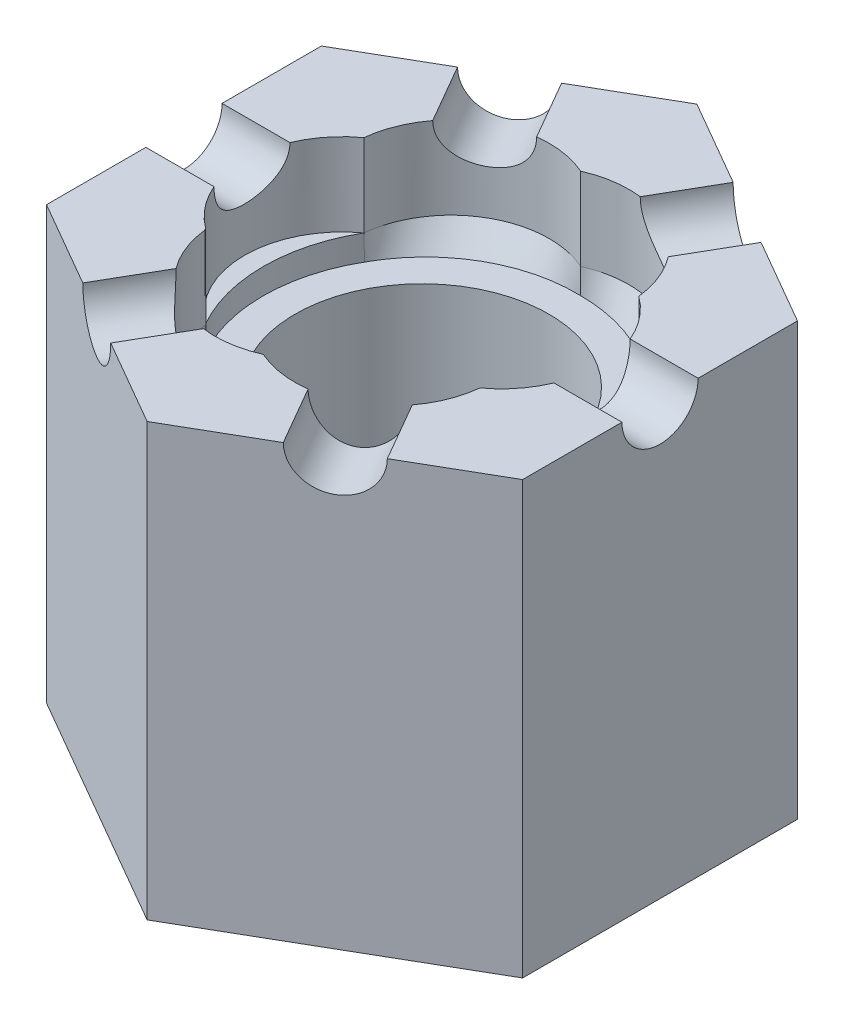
ISO-10303-21;
HEADER;
FILE_DESCRIPTION(('STEP AP214'),'2;1');
FILE_NAME('part.step','',(''),(''),'','','');
FILE_SCHEMA(('AUTOMOTIVE_DESIGN { 1 0 10303 214 1 1 1 1 }'));
ENDSEC;
DATA;
#1=APPLICATION_CONTEXT('core data for automotive mechanical design processes');
#2=APPLICATION_PROTOCOL_DEFINITION('international standard','automotive_design',2000,#1);
#3=PRODUCT_CONTEXT('',#1,'mechanical');
#4=PRODUCT('Part','Part','',(#3));
#5=PRODUCT_RELATED_PRODUCT_CATEGORY('part','',(#4));
#6=PRODUCT_DEFINITION_FORMATION('','',#4);
#7=PRODUCT_DEFINITION_CONTEXT('part definition',#1,'design');
#8=PRODUCT_DEFINITION('design','',#6,#7);
#9=PRODUCT_DEFINITION_SHAPE('','',#8);
#10=(LENGTH_UNIT() NAMED_UNIT(*) SI_UNIT(.MILLI.,.METRE.));
#11=(NAMED_UNIT(*) PLANE_ANGLE_UNIT() SI_UNIT($,.RADIAN.));
#12=(NAMED_UNIT(*) SI_UNIT($,.STERADIAN.) SOLID_ANGLE_UNIT());
#13=UNCERTAINTY_MEASURE_WITH_UNIT(LENGTH_MEASURE(1.E-05),#10,'distance_accuracy_value','');
#14=(GEOMETRIC_REPRESENTATION_CONTEXT(3) GLOBAL_UNCERTAINTY_ASSIGNED_CONTEXT((#13)) GLOBAL_UNIT_ASSIGNED_CONTEXT((#10,
#11,#12)) REPRESENTATION_CONTEXT('',''));
#15=CARTESIAN_POINT('',(0.,0.,0.));
#16=DIRECTION('',(0.,0.,1.));
#17=DIRECTION('',(1.,0.,0.));
#18=AXIS2_PLACEMENT_3D('',#15,#16,#17);
#19=CARTESIAN_POINT('',(-39.812134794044,34.,-64.95));
#20=DIRECTION('',(0.,1.,0.));
#21=DIRECTION('',(0.,0.,1.));
#22=AXIS2_PLACEMENT_3D('',#19,#20,#21);
#23=PLANE('',#22);
#24=DIRECTION('',(-0.5,0.,0.866025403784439));
#25=VECTOR('',#24,1.);
#26=CARTESIAN_POINT('',(45.0157524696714,34.,-83.9934641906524));
#27=LINE('',#26,#25);
#28=CARTESIAN_POINT('',(28.2028924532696,34.,-54.8727364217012));
#29=VERTEX_POINT('',#28);
#30=CARTESIAN_POINT('',(25.5157524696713,34.,-50.2184734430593));
#31=VERTEX_POINT('',#30);
#32=EDGE_CURVE('E280',#29,#31,#27,.T.);
#33=ORIENTED_EDGE('',*,*,#32,.F.);
#34=CARTESIAN_POINT('',(34.3671378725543,34.,-59.4777451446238));
#35=DIRECTION('',(0.,1.,0.));
#36=DIRECTION('',(0.,0.,1.));
#37=AXIS2_PLACEMENT_3D('',#34,#35,#36);
#38=CIRCLE('',#37,7.69441530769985);
#39=CARTESIAN_POINT('',(26.7205431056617,34.,-58.6212316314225));
#40=VERTEX_POINT('',#39);
#41=EDGE_CURVE('E346',#29,#40,#38,.F.);
#42=ORIENTED_EDGE('',*,*,#41,.T.);
#43=CARTESIAN_POINT('',(37.4999999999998,34.,-64.95));
#44=DIRECTION('',(0.,1.,0.));
#45=DIRECTION('',(0.,0.,1.));
#46=AXIS2_PLACEMENT_3D('',#43,#44,#45);
#47=CIRCLE('',#46,12.5);
#48=CARTESIAN_POINT('',(26.6293920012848,34.,-58.7791101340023));
#49=VERTEX_POINT('',#48);
#50=EDGE_CURVE('E320',#49,#40,#47,.T.);
#51=ORIENTED_EDGE('',*,*,#50,.F.);
#52=CARTESIAN_POINT('',(31.1944518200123,34.,-64.9729920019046));
#53=DIRECTION('',(0.,1.,0.));
#54=DIRECTION('',(0.,0.,1.));
#55=AXIS2_PLACEMENT_3D('',#52,#53,#54);
#56=CIRCLE('',#55,7.69440990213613);
#57=CARTESIAN_POINT('',(24.1187565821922,34.,-61.95));
#58=VERTEX_POINT('',#57);
#59=EDGE_CURVE('E351',#58,#49,#56,.T.);
#60=ORIENTED_EDGE('',*,*,#59,.F.);
#61=DIRECTION('',(1.,0.,0.));
#62=VECTOR('',#61,1.);
#63=CARTESIAN_POINT('',(17.2499999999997,34.,-61.95));
#64=LINE('',#63,#62);
#65=CARTESIAN_POINT('',(18.7499999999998,34.,-61.95));
#66=VERTEX_POINT('',#65);
#67=EDGE_CURVE('E966',#66,#58,#64,.T.);
#68=ORIENTED_EDGE('',*,*,#67,.F.);
#69=DIRECTION('',(0.,0.,-1.));
#70=VECTOR('',#69,1.);
#71=CARTESIAN_POINT('',(18.7499999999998,34.,-64.95));
#72=LINE('',#71,#70);
#73=CARTESIAN_POINT('',(18.7499999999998,34.,-54.1246824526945));
#74=VERTEX_POINT('',#73);
#75=EDGE_CURVE('E311',#74,#66,#72,.T.);
#76=ORIENTED_EDGE('',*,*,#75,.F.);
#77=DIRECTION('',(0.866025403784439,0.,0.5));
#78=VECTOR('',#77,1.);
#79=CARTESIAN_POINT('',(-29.859101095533,34.,-82.1891600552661));
#80=LINE('',#79,#78);
#81=EDGE_CURVE('E300',#74,#31,#80,.T.);
#82=ORIENTED_EDGE('',*,*,#81,.T.);
#83=EDGE_LOOP('',(#33,#42,#51,#60,#68,#76,#82));
#84=FACE_BOUND('',#83,.T.);
#85=ADVANCED_FACE('F68',(#84),#23,.T.);
#86=CARTESIAN_POINT('',(44.2657524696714,34.,-82.6944260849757));
#87=VERTEX_POINT('',#86);
#88=CARTESIAN_POINT('',(41.5854917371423,34.,-78.0520783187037));
#89=VERTEX_POINT('',#88);
#90=EDGE_CURVE('E96',#87,#89,#27,.T.);
#91=ORIENTED_EDGE('',*,*,#90,.F.);
#92=DIRECTION('',(-0.866025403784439,0.,-0.5));
#93=VECTOR('',#92,1.);
#94=CARTESIAN_POINT('',(-11.1091010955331,34.,-114.665112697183));
#95=LINE('',#94,#93);
#96=CARTESIAN_POINT('',(37.4999999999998,34.,-86.600635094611));
#97=VERTEX_POINT('',#96);
#98=EDGE_CURVE('E319',#87,#97,#95,.T.);
#99=ORIENTED_EDGE('',*,*,#98,.T.);
#100=DIRECTION('',(-0.866025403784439,0.,0.499999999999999));
#101=VECTOR('',#100,1.);
#102=CARTESIAN_POINT('',(-29.8591010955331,34.,-47.7108399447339));
#103=LINE('',#102,#101);
#104=CARTESIAN_POINT('',(30.7446749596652,34.,-82.7004463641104));
#105=VERTEX_POINT('',#104);
#106=EDGE_CURVE('E301',#97,#105,#103,.T.);
#107=ORIENTED_EDGE('',*,*,#106,.T.);
#108=DIRECTION('',(0.5,0.,0.866025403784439));
#109=VECTOR('',#108,1.);
#110=CARTESIAN_POINT('',(29.9946749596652,34.,-83.9994844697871));
#111=LINE('',#110,#109);
#112=CARTESIAN_POINT('',(33.4274860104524,34.,-78.0536813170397));
#113=VERTEX_POINT('',#112);
#114=EDGE_CURVE('E976',#105,#113,#111,.T.);
#115=ORIENTED_EDGE('',*,*,#114,.T.);
#116=CARTESIAN_POINT('',(34.3697656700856,34.,-70.3717248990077));
#117=DIRECTION('',(0.,1.,0.));
#118=DIRECTION('',(0.,0.,1.));
#119=AXIS2_PLACEMENT_3D('',#116,#117,#118);
#120=CIRCLE('',#119,7.73953134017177);
#121=CARTESIAN_POINT('',(37.4999999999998,34.,-77.45));
#122=VERTEX_POINT('',#121);
#123=EDGE_CURVE('E352',#122,#113,#120,.T.);
#124=ORIENTED_EDGE('',*,*,#123,.F.);
#125=CARTESIAN_POINT('',(40.6302343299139,34.,-70.3717248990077));
#126=DIRECTION('',(0.,1.,0.));
#127=DIRECTION('',(0.,0.,1.));
#128=AXIS2_PLACEMENT_3D('',#125,#126,#127);
#129=CIRCLE('',#128,7.73953134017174);
#130=EDGE_CURVE('E357',#122,#89,#129,.F.);
#131=ORIENTED_EDGE('',*,*,#130,.T.);
#132=EDGE_LOOP('',(#91,#99,#107,#115,#124,#131));
#133=FACE_BOUND('',#132,.T.);
#134=ADVANCED_FACE('F733',(#133),#23,.T.);
#135=DIRECTION('',(-0.5,0.,0.866025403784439));
#136=VECTOR('',#135,1.);
#137=CARTESIAN_POINT('',(50.2122191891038,34.,-80.9932827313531));
#138=LINE('',#137,#136);
#139=CARTESIAN_POINT('',(33.3842393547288,34.,-51.8463666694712));
#140=VERTEX_POINT('',#139);
#141=CARTESIAN_POINT('',(30.7122191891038,34.,-47.21829198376));
#142=VERTEX_POINT('',#141);
#143=EDGE_CURVE('E89',#140,#142,#138,.T.);
#144=ORIENTED_EDGE('',*,*,#143,.T.);
#145=CARTESIAN_POINT('',(37.4999999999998,34.,-43.299364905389));
#146=VERTEX_POINT('',#145);
#147=EDGE_CURVE('E290',#142,#146,#80,.T.);
#148=ORIENTED_EDGE('',*,*,#147,.T.);
#149=DIRECTION('',(0.866025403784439,0.,-0.5));
#150=VECTOR('',#149,1.);
#151=CARTESIAN_POINT('',(-11.109101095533,34.,-15.2348873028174));
#152=LINE('',#151,#150);
#153=CARTESIAN_POINT('',(44.2985225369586,34.,-47.2244937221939));
#154=VERTEX_POINT('',#153);
#155=EDGE_CURVE('E309',#146,#154,#152,.T.);
#156=ORIENTED_EDGE('',*,*,#155,.T.);
#157=DIRECTION('',(0.5,0.,0.866025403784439));
#158=VECTOR('',#157,1.);
#159=CARTESIAN_POINT('',(24.7985225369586,34.,-80.9994844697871));
#160=LINE('',#159,#158);
#161=CARTESIAN_POINT('',(41.6261987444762,34.,-51.8530943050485));
#162=VERTEX_POINT('',#161);
#163=EDGE_CURVE('E975',#162,#154,#160,.T.);
#164=ORIENTED_EDGE('',*,*,#163,.F.);
#165=CARTESIAN_POINT('',(40.6302343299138,34.,-59.5282751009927));
#166=DIRECTION('',(0.,1.,0.));
#167=DIRECTION('',(0.,0.,1.));
#168=AXIS2_PLACEMENT_3D('',#165,#166,#167);
#169=CIRCLE('',#168,7.73953134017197);
#170=CARTESIAN_POINT('',(37.4999999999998,34.,-52.45));
#171=VERTEX_POINT('',#170);
#172=EDGE_CURVE('E366',#162,#171,#169,.F.);
#173=ORIENTED_EDGE('',*,*,#172,.T.);
#174=EDGE_CURVE('E293',#171,#140,#38,.F.);
#175=ORIENTED_EDGE('',*,*,#174,.T.);
#176=EDGE_LOOP('',(#144,#148,#156,#164,#173,#175));
#177=FACE_BOUND('',#176,.T.);
#178=ADVANCED_FACE('F288',(#177),#23,.T.);
#179=CARTESIAN_POINT('',(50.8949164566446,34.,-61.95));
#180=VERTEX_POINT('',#179);
#181=CARTESIAN_POINT('',(56.2499999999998,34.,-61.95));
#182=VERTEX_POINT('',#181);
#183=EDGE_CURVE('E771',#180,#182,#64,.T.);
#184=ORIENTED_EDGE('',*,*,#183,.F.);
#185=CARTESIAN_POINT('',(43.7604686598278,34.,-64.9500000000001));
#186=DIRECTION('',(0.,1.,0.));
#187=DIRECTION('',(0.,0.,1.));
#188=AXIS2_PLACEMENT_3D('',#185,#186,#187);
#189=CIRCLE('',#188,7.73953134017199);
#190=CARTESIAN_POINT('',(48.3253175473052,34.,-58.7));
#191=VERTEX_POINT('',#190);
#192=EDGE_CURVE('E360',#180,#191,#189,.F.);
#193=ORIENTED_EDGE('',*,*,#192,.T.);
#194=CARTESIAN_POINT('',(46.8118639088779,34.,-54.8712587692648));
#195=VERTEX_POINT('',#194);
#196=EDGE_CURVE('E363',#191,#195,#169,.F.);
#197=ORIENTED_EDGE('',*,*,#196,.T.);
#198=CARTESIAN_POINT('',(49.4946749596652,34.,-50.224493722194));
#199=VERTEX_POINT('',#198);
#200=EDGE_CURVE('E515',#195,#199,#111,.T.);
#201=ORIENTED_EDGE('',*,*,#200,.T.);
#202=CARTESIAN_POINT('',(56.2499999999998,34.,-54.1246824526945));
#203=VERTEX_POINT('',#202);
#204=EDGE_CURVE('E303',#199,#203,#152,.T.);
#205=ORIENTED_EDGE('',*,*,#204,.T.);
#206=DIRECTION('',(0.,0.,-1.));
#207=VECTOR('',#206,1.);
#208=CARTESIAN_POINT('',(56.2499999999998,34.,-64.95));
#209=LINE('',#208,#207);
#210=EDGE_CURVE('E942',#203,#182,#209,.T.);
#211=ORIENTED_EDGE('',*,*,#210,.T.);
#212=EDGE_LOOP('',(#184,#193,#197,#201,#205,#211));
#213=FACE_BOUND('',#212,.T.);
#214=ADVANCED_FACE('F756',(#213),#23,.T.);
#215=DIRECTION('',(1.,0.,0.));
#216=VECTOR('',#215,1.);
#217=CARTESIAN_POINT('',(17.2499999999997,34.,-67.95));
#218=LINE('',#217,#216);
#219=CARTESIAN_POINT('',(18.7499999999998,34.,-67.95));
#220=VERTEX_POINT('',#219);
#221=CARTESIAN_POINT('',(24.0992867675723,34.,-67.95));
#222=VERTEX_POINT('',#221);
#223=EDGE_CURVE('E767',#220,#222,#218,.T.);
#224=ORIENTED_EDGE('',*,*,#223,.T.);
#225=CARTESIAN_POINT('',(26.6746824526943,34.,-71.2));
#226=VERTEX_POINT('',#225);
#227=EDGE_CURVE('E347',#226,#222,#56,.T.);
#228=ORIENTED_EDGE('',*,*,#227,.F.);
#229=CARTESIAN_POINT('',(28.2208463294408,34.,-75.071845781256));
#230=VERTEX_POINT('',#229);
#231=EDGE_CURVE('E356',#230,#226,#120,.T.);
#232=ORIENTED_EDGE('',*,*,#231,.F.);
#233=CARTESIAN_POINT('',(25.5485225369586,34.,-79.7004463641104));
#234=VERTEX_POINT('',#233);
#235=EDGE_CURVE('E514',#234,#230,#160,.T.);
#236=ORIENTED_EDGE('',*,*,#235,.F.);
#237=CARTESIAN_POINT('',(18.7499999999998,34.,-75.7753175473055));
#238=VERTEX_POINT('',#237);
#239=EDGE_CURVE('E305',#234,#238,#103,.T.);
#240=ORIENTED_EDGE('',*,*,#239,.T.);
#241=EDGE_CURVE('E314',#220,#238,#72,.T.);
#242=ORIENTED_EDGE('',*,*,#241,.F.);
#243=EDGE_LOOP('',(#224,#228,#232,#236,#240,#242));
#244=FACE_BOUND('',#243,.T.);
#245=ADVANCED_FACE('F746',(#244),#23,.T.);
#246=CARTESIAN_POINT('',(6.97054194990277,25.5,-64.9475207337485));
#247=DIRECTION('',(0.,1.,0.));
#248=DIRECTION('',(0.,0.,1.));
#249=AXIS2_PLACEMENT_3D('',#246,#247,#248);
#250=PLANE('',#249);
#251=CARTESIAN_POINT('',(37.4999999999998,25.5,-64.95));
#252=DIRECTION('',(0.,1.,0.));
#253=DIRECTION('',(0.,0.,1.));
#254=AXIS2_PLACEMENT_3D('',#251,#252,#253);
#255=CIRCLE('',#254,10.);
#256=CARTESIAN_POINT('',(37.4999999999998,25.5,-54.95));
#257=VERTEX_POINT('',#256);
#258=EDGE_CURVE('E367',#257,#257,#255,.F.);
#259=ORIENTED_EDGE('',*,*,#258,.T.);
#260=EDGE_LOOP('',(#259));
#261=FACE_BOUND('',#260,.T.);
#262=CARTESIAN_POINT('',(34.3671378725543,25.5,-59.4777451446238));
#263=DIRECTION('',(0.,1.,0.));
#264=DIRECTION('',(0.,0.,1.));
#265=AXIS2_PLACEMENT_3D('',#262,#263,#264);
#266=CIRCLE('',#265,7.69441530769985);
#267=CARTESIAN_POINT('',(26.7100809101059,25.5,-58.7204436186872));
#268=VERTEX_POINT('',#267);
#269=CARTESIAN_POINT('',(26.7205431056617,25.5,-58.6212316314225));
#270=VERTEX_POINT('',#269);
#271=EDGE_CURVE('E370',#268,#270,#266,.T.);
#272=ORIENTED_EDGE('',*,*,#271,.T.);
#273=CARTESIAN_POINT('',(37.4999999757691,25.5,-52.4499430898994));
#274=CARTESIAN_POINT('',(36.9826325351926,25.5,-52.4364989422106));
#275=CARTESIAN_POINT('',(36.4546263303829,25.5,-52.4569506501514));
#276=CARTESIAN_POINT('',(35.3915704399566,25.5,-52.5701133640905));
#277=CARTESIAN_POINT('',(34.8565207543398,25.5,-52.6628243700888));
#278=CARTESIAN_POINT('',(33.7936119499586,25.5,-52.9249732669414));
#279=CARTESIAN_POINT('',(33.2661246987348,25.5,-53.0945278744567));
#280=CARTESIAN_POINT('',(32.2347044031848,25.5,-53.5067450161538));
#281=CARTESIAN_POINT('',(31.7307713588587,25.5,-53.7494075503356));
#282=CARTESIAN_POINT('',(30.7620793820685,25.5,-54.3039881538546));
#283=CARTESIAN_POINT('',(30.2976781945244,25.5,-54.6157014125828));
#284=CARTESIAN_POINT('',(29.4199958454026,25.5,-55.2964542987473));
#285=CARTESIAN_POINT('',(29.0067146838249,25.5,-55.6654939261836));
#286=CARTESIAN_POINT('',(28.2425028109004,25.5,-56.4493800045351));
#287=CARTESIAN_POINT('',(27.8916597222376,25.5,-56.8638466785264));
#288=CARTESIAN_POINT('',(27.2558531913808,25.5,-57.7232904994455));
#289=CARTESIAN_POINT('',(26.9708897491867,25.5,-58.1682676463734));
#290=CARTESIAN_POINT('',(26.7205431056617,25.5,-58.6212316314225));
#291=B_SPLINE_CURVE_WITH_KNOTS('',3,(#273,#274,#275,#276,#277,#278,#279,#280,#281,#282,#283,
#284,#285,#286,#287,#288,#289,#290),.UNSPECIFIED.,.F.,.F.,(4,2,2,2,2,2,2,2,4),(0.,0.125,0.25,
0.375,0.5,0.625,0.75,0.875,1.),.UNSPECIFIED.);
#292=CARTESIAN_POINT('',(37.4789609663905,25.5,-52.4498398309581));
#293=VERTEX_POINT('',#292);
#294=EDGE_CURVE('E470',#270,#293,#291,.F.);
#295=ORIENTED_EDGE('',*,*,#294,.T.);
#296=CARTESIAN_POINT('',(37.4999999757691,25.5,-52.4499430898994));
#297=CARTESIAN_POINT('',(36.9826325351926,25.5,-52.4364989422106));
#298=CARTESIAN_POINT('',(36.4546263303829,25.5,-52.4569506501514));
#299=CARTESIAN_POINT('',(35.3915704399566,25.5,-52.5701133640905));
#300=CARTESIAN_POINT('',(34.8565207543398,25.5,-52.6628243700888));
#301=CARTESIAN_POINT('',(33.7936119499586,25.5,-52.9249732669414));
#302=CARTESIAN_POINT('',(33.2661246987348,25.5,-53.0945278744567));
#303=CARTESIAN_POINT('',(32.2347044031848,25.5,-53.5067450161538));
#304=CARTESIAN_POINT('',(31.7307713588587,25.5,-53.7494075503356));
#305=CARTESIAN_POINT('',(30.7620793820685,25.5,-54.3039881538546));
#306=CARTESIAN_POINT('',(30.2976781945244,25.5,-54.6157014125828));
#307=CARTESIAN_POINT('',(29.4199958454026,25.5,-55.2964542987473));
#308=CARTESIAN_POINT('',(29.0067146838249,25.5,-55.6654939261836));
#309=CARTESIAN_POINT('',(28.2425028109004,25.5,-56.4493800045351));
#310=CARTESIAN_POINT('',(27.8916597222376,25.5,-56.8638466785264));
#311=CARTESIAN_POINT('',(27.2558531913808,25.5,-57.7232904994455));
#312=CARTESIAN_POINT('',(26.9708897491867,25.5,-58.1682676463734));
#313=CARTESIAN_POINT('',(26.7205431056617,25.5,-58.6212316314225));
#314=B_SPLINE_CURVE_WITH_KNOTS('',3,(#296,#297,#298,#299,#300,#301,#302,#303,#304,#305,#306,
#307,#308,#309,#310,#311,#312,#313),.UNSPECIFIED.,.F.,.F.,(4,2,2,2,2,2,2,2,4),(0.,0.125,0.25,
0.375,0.5,0.625,0.75,0.875,1.),.UNSPECIFIED.);
#315=CARTESIAN_POINT('',(37.4999999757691,25.5,-52.4499430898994));
#316=VERTEX_POINT('',#315);
#317=EDGE_CURVE('E486',#316,#293,#314,.T.);
#318=ORIENTED_EDGE('',*,*,#317,.F.);
#319=CARTESIAN_POINT('',(37.5062083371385,25.5,-52.4498868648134));
#320=CARTESIAN_POINT('',(37.5041392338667,25.5,-52.4499245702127));
#321=CARTESIAN_POINT('',(37.5020701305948,25.5,-52.449962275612));
#322=CARTESIAN_POINT('',(37.500001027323,25.5,-52.4499999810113));
#323=B_SPLINE_CURVE_WITH_KNOTS('',3,(#319,#320,#321,#322),.UNSPECIFIED.,.F.,.F.,(4,4),(0.,
0.00620834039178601),.UNSPECIFIED.);
#324=CARTESIAN_POINT('',(37.5062093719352,25.5,-52.4499444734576));
#325=VERTEX_POINT('',#324);
#326=EDGE_CURVE('E605',#325,#316,#323,.T.);
#327=ORIENTED_EDGE('',*,*,#326,.F.);
#328=CARTESIAN_POINT('',(48.4822992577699,25.5,-58.9801218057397));
#329=CARTESIAN_POINT('',(48.2367277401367,25.5,-58.5077653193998));
#330=CARTESIAN_POINT('',(47.9547183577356,25.5,-58.0426633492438));
#331=CARTESIAN_POINT('',(47.3209230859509,25.5,-57.1425351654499));
#332=CARTESIAN_POINT('',(46.9691371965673,25.5,-56.707508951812));
#333=CARTESIAN_POINT('',(46.1988881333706,25.5,-55.8830990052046));
#334=CARTESIAN_POINT('',(45.7805087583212,25.5,-55.4941361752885));
#335=CARTESIAN_POINT('',(44.8889552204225,25.5,-54.7752334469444));
#336=CARTESIAN_POINT('',(44.4157810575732,25.5,-54.4452935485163));
#337=CARTESIAN_POINT('',(43.4263528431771,25.5,-53.8569753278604));
#338=CARTESIAN_POINT('',(42.9104896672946,25.5,-53.5988294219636));
#339=CARTESIAN_POINT('',(41.8530763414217,25.5,-53.1588681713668));
#340=CARTESIAN_POINT('',(41.3115261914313,25.5,-52.9770528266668));
#341=CARTESIAN_POINT('',(40.2193500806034,25.5,-52.6940568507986));
#342=CARTESIAN_POINT('',(39.6691339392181,25.5,-52.5927488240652));
#343=CARTESIAN_POINT('',(38.5756022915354,25.5,-52.4658010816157));
#344=CARTESIAN_POINT('',(38.0322867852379,25.5,-52.4401613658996));
#345=CARTESIAN_POINT('',(37.4999999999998,25.5,-52.45));
#346=B_SPLINE_CURVE_WITH_KNOTS('',3,(#328,#329,#330,#331,#332,#333,#334,#335,#336,#337,#338,
#339,#340,#341,#342,#343,#344,#345),.UNSPECIFIED.,.F.,.F.,(4,2,2,2,2,2,2,2,4),(0.,0.125,0.25,
0.375,0.5,0.625,0.75,0.875,1.),.UNSPECIFIED.);
#347=CARTESIAN_POINT('',(48.4821930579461,25.5013530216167,-58.9799323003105));
#348=VERTEX_POINT('',#347);
#349=EDGE_CURVE('E673',#325,#348,#346,.F.);
#350=ORIENTED_EDGE('',*,*,#349,.T.);
#351=CARTESIAN_POINT('',(48.4822998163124,25.5,-58.9801214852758));
#352=CARTESIAN_POINT('',(48.566528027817,25.5,-59.1269387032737));
#353=CARTESIAN_POINT('',(48.6476027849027,25.5,-59.2755384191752));
#354=CARTESIAN_POINT('',(48.8033803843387,25.5,-59.5760367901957));
#355=CARTESIAN_POINT('',(48.8780833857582,25.5,-59.7279353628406));
#356=CARTESIAN_POINT('',(49.0925019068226,25.5,-60.1881025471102));
#357=CARTESIAN_POINT('',(49.2225758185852,25.5,-60.5009279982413));
#358=CARTESIAN_POINT('',(49.4559066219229,25.5,-61.1360037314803));
#359=CARTESIAN_POINT('',(49.5591930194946,25.5,-61.4582432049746));
#360=CARTESIAN_POINT('',(49.7378303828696,25.5,-62.1103786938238));
#361=CARTESIAN_POINT('',(49.8131811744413,25.5,-62.4402747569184));
#362=CARTESIAN_POINT('',(49.9359261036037,25.5,-63.1053544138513));
#363=CARTESIAN_POINT('',(49.9833120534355,25.5,-63.4405395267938));
#364=CARTESIAN_POINT('',(50.0332635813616,25.5,-63.9453180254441));
#365=CARTESIAN_POINT('',(50.04639313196,25.5,-64.1139291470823));
#366=CARTESIAN_POINT('',(50.0655428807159,25.5,-64.4515639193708));
#367=CARTESIAN_POINT('',(50.071563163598,25.5,-64.620587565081));
#368=CARTESIAN_POINT('',(50.0763908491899,25.5,-64.9588144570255));
#369=CARTESIAN_POINT('',(50.0751950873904,25.5,-65.1280177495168));
#370=CARTESIAN_POINT('',(50.0655554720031,25.5,-65.4662027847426));
#371=CARTESIAN_POINT('',(50.0571115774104,25.5,-65.6351845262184));
#372=CARTESIAN_POINT('',(50.0210922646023,25.5,-66.1413793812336));
#373=CARTESIAN_POINT('',(49.9828302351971,25.5,-66.4779189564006));
#374=CARTESIAN_POINT('',(49.9044645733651,25.5,-66.9793886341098));
#375=CARTESIAN_POINT('',(49.8748330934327,25.5,-67.1460467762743));
#376=CARTESIAN_POINT('',(49.8085946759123,25.5,-67.4779861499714));
#377=CARTESIAN_POINT('',(49.7719877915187,25.5,-67.6432673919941));
#378=CARTESIAN_POINT('',(49.6917970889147,25.5,-67.9721497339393));
#379=CARTESIAN_POINT('',(49.6482124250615,25.5,-68.1357506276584));
#380=CARTESIAN_POINT('',(49.554060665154,25.5,-68.4609200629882));
#381=CARTESIAN_POINT('',(49.5034936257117,25.5,-68.6224886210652));
#382=CARTESIAN_POINT('',(49.3417906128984,25.5,-69.1031542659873));
#383=CARTESIAN_POINT('',(49.2204874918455,25.5,-69.4188867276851));
#384=CARTESIAN_POINT('',(48.9519854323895,25.5,-70.0389408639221));
#385=CARTESIAN_POINT('',(48.8048013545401,25.5,-70.3432689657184));
#386=CARTESIAN_POINT('',(48.5943209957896,25.5,-70.7354582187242));
#387=CARTESIAN_POINT('',(48.5422457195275,25.5,-70.8294443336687));
#388=CARTESIAN_POINT('',(48.4356335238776,25.5,-71.0158723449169));
#389=CARTESIAN_POINT('',(48.381099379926,25.5,-71.1083158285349));
#390=CARTESIAN_POINT('',(48.3253119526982,25.5,-71.2000096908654));
#391=B_SPLINE_CURVE_WITH_KNOTS('',3,(#351,#352,#353,#354,#355,#356,#357,#358,#359,#360,#361,
#362,#363,#364,#365,#366,#367,#368,#369,#370,#371,#372,#373,#374,#375,#376,#377,#378,#379,#380,
#381,#382,#383,#384,#385,#386,#387,#388,#389,#390),.UNSPECIFIED.,.F.,.F.,(4,2,2,2,2,2,2,2,2,2,2,
2,2,2,2,2,2,2,2,4),(0.,0.507703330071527,1.01539398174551,2.03048111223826,3.04444534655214,
4.05841590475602,5.07268319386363,5.57992541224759,6.08716158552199,6.59462021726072,
7.10208171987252,8.11677491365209,8.62447981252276,9.13218083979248,9.63994344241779,
10.1477019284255,11.1611397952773,12.1739976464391,12.4963149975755,12.818277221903),.UNSPECIFIED.);
#392=CARTESIAN_POINT('',(48.3253119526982,25.5,-71.2000096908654));
#393=VERTEX_POINT('',#392);
#394=EDGE_CURVE('E550',#348,#393,#391,.T.);
#395=ORIENTED_EDGE('',*,*,#394,.T.);
#396=CARTESIAN_POINT('',(48.3253119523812,25.5,-71.2000096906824));
#397=CARTESIAN_POINT('',(48.2078268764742,25.5,-71.4034629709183));
#398=CARTESIAN_POINT('',(48.0845511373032,25.5,-71.6035628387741));
#399=CARTESIAN_POINT('',(47.8269339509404,25.5,-71.9964875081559));
#400=CARTESIAN_POINT('',(47.6925933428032,25.5,-72.1893128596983));
#401=CARTESIAN_POINT('',(47.4133503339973,25.5,-72.5671427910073));
#402=CARTESIAN_POINT('',(47.268448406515,25.5,-72.7521477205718));
#403=CARTESIAN_POINT('',(46.9687721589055,25.5,-73.1134299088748));
#404=CARTESIAN_POINT('',(46.8140157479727,25.5,-73.2897220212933));
#405=CARTESIAN_POINT('',(46.494764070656,25.5,-73.6332609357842));
#406=CARTESIAN_POINT('',(46.3302690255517,25.5,-73.8005079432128));
#407=CARTESIAN_POINT('',(45.9920418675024,25.5,-74.1253634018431));
#408=CARTESIAN_POINT('',(45.8183093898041,25.5,-74.2829714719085));
#409=CARTESIAN_POINT('',(45.3730852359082,25.5,-74.6647391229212));
#410=CARTESIAN_POINT('',(45.0962111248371,25.5,-74.8826957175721));
#411=CARTESIAN_POINT('',(44.6680541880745,25.5,-75.1916056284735));
#412=CARTESIAN_POINT('',(44.5231782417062,25.5,-75.2915810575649));
#413=CARTESIAN_POINT('',(44.2293322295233,25.5,-75.4853400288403));
#414=CARTESIAN_POINT('',(44.0803623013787,25.5,-75.5791237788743));
#415=CARTESIAN_POINT('',(43.7785122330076,25.5,-75.7602499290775));
#416=CARTESIAN_POINT('',(43.6256312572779,25.5,-75.8475909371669));
#417=CARTESIAN_POINT('',(43.3162917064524,25.5,-76.0156684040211));
#418=CARTESIAN_POINT('',(43.1598330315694,25.5,-76.0964046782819));
#419=CARTESIAN_POINT('',(42.6855463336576,25.5,-76.3286330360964));
#420=CARTESIAN_POINT('',(42.3627587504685,25.5,-76.4701739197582));
#421=CARTESIAN_POINT('',(41.7947197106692,25.5,-76.6914290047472));
#422=CARTESIAN_POINT('',(41.5519212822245,25.5,-76.7775395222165));
#423=CARTESIAN_POINT('',(41.0614225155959,25.5,-76.9345887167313));
#424=CARTESIAN_POINT('',(40.813721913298,25.5,-77.0055265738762));
#425=CARTESIAN_POINT('',(40.3143548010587,25.5,-77.1317578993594));
#426=CARTESIAN_POINT('',(40.0626880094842,25.5,-77.1870502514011));
#427=CARTESIAN_POINT('',(39.5557882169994,25.5,-77.2821659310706));
#428=CARTESIAN_POINT('',(39.3005477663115,25.5,-77.3219495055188));
#429=CARTESIAN_POINT('',(38.7880956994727,25.5,-77.385766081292));
#430=CARTESIAN_POINT('',(38.5308840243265,25.5,-77.4097986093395));
#431=CARTESIAN_POINT('',(38.0154594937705,25.5,-77.4419129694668));
#432=CARTESIAN_POINT('',(37.757246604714,25.5,-77.4499942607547));
#433=CARTESIAN_POINT('',(37.4990230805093,25.5,-77.45));
#434=B_SPLINE_CURVE_WITH_KNOTS('',3,(#396,#397,#398,#399,#400,#401,#402,#403,#404,#405,#406,
#407,#408,#409,#410,#411,#412,#413,#414,#415,#416,#417,#418,#419,#420,#421,#422,#423,#424,#425,
#426,#427,#428,#429,#430,#431,#432,#433),.UNSPECIFIED.,.F.,.F.,(4,2,2,2,2,2,2,2,2,2,2,2,2,2,2,2,
2,2,4),(0.,0.70470750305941,1.40936161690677,2.11398417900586,2.81736084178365,3.52072152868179,
4.22411000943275,5.27978454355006,5.80773352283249,6.33566477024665,6.86370975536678,
7.39176948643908,8.44771854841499,9.22013432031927,9.99259182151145,10.7651044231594,
11.5395843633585,12.3140875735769,13.0886170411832),.UNSPECIFIED.);
#435=CARTESIAN_POINT('',(37.4990230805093,25.5,-77.4500628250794));
#436=VERTEX_POINT('',#435);
#437=EDGE_CURVE('E643',#393,#436,#434,.T.);
#438=ORIENTED_EDGE('',*,*,#437,.T.);
#439=CARTESIAN_POINT('',(37.4990230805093,25.5,-77.4500628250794));
#440=CARTESIAN_POINT('',(37.3324498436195,25.5,-77.4555684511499));
#441=CARTESIAN_POINT('',(37.1657801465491,25.5,-77.4575031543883));
#442=CARTESIAN_POINT('',(36.8325128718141,25.5,-77.4543031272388));
#443=CARTESIAN_POINT('',(36.665915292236,25.5,-77.4491685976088));
#444=CARTESIAN_POINT('',(36.1667021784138,25.5,-77.4232745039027));
#445=CARTESIAN_POINT('',(35.8345778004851,25.5,-77.3920272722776));
#446=CARTESIAN_POINT('',(35.1744202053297,25.5,-77.3018497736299));
#447=CARTESIAN_POINT('',(34.8463834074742,25.5,-77.242945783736));
#448=CARTESIAN_POINT('',(34.3590517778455,25.5,-77.1338077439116));
#449=CARTESIAN_POINT('',(34.1973776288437,25.5,-77.0939591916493));
#450=CARTESIAN_POINT('',(33.8758821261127,25.5,-77.0073804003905));
#451=CARTESIAN_POINT('',(33.716060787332,25.5,-76.960650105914));
#452=CARTESIAN_POINT('',(33.2396923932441,25.5,-76.8104091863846));
#453=CARTESIAN_POINT('',(32.9262596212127,25.5,-76.6968527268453));
#454=CARTESIAN_POINT('',(32.3099649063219,25.5,-76.4439735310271));
#455=CARTESIAN_POINT('',(32.0071028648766,25.5,-76.3046510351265));
#456=CARTESIAN_POINT('',(31.5624746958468,25.5,-76.076863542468));
#457=CARTESIAN_POINT('',(31.4158421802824,25.5,-75.9977792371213));
#458=CARTESIAN_POINT('',(31.12610662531,25.5,-75.8333717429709));
#459=CARTESIAN_POINT('',(30.9830035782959,25.5,-75.7480485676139));
#460=CARTESIAN_POINT('',(30.7005574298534,25.5,-75.5713927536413));
#461=CARTESIAN_POINT('',(30.5612143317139,25.5,-75.4800601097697));
#462=CARTESIAN_POINT('',(30.2865017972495,25.5,-75.2916190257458));
#463=CARTESIAN_POINT('',(30.1511323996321,25.5,-75.1945105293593));
#464=CARTESIAN_POINT('',(29.7513967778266,25.5,-74.8949000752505));
#465=CARTESIAN_POINT('',(29.4932397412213,25.5,-74.6840107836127));
#466=CARTESIAN_POINT('',(28.9955581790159,25.5,-74.2412911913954));
#467=CARTESIAN_POINT('',(28.756034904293,25.5,-74.0094594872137));
#468=CARTESIAN_POINT('',(28.2980320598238,25.5,-73.5264418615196));
#469=CARTESIAN_POINT('',(28.0795254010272,25.5,-73.2752816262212));
#470=CARTESIAN_POINT('',(27.6643851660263,25.5,-72.7556570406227));
#471=CARTESIAN_POINT('',(27.4677416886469,25.5,-72.4872006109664));
#472=CARTESIAN_POINT('',(27.1762565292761,25.5,-72.0522089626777));
#473=CARTESIAN_POINT('',(27.0736549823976,25.5,-71.8908223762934));
#474=CARTESIAN_POINT('',(26.8765763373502,25.5,-71.563529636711));
#475=CARTESIAN_POINT('',(26.7820859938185,25.5,-71.3976314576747));
#476=CARTESIAN_POINT('',(26.6917051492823,25.5,-71.2294938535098));
#477=B_SPLINE_CURVE_WITH_KNOTS('',3,(#439,#440,#441,#442,#443,#444,#445,#446,#447,#448,#449,
#450,#451,#452,#453,#454,#455,#456,#457,#458,#459,#460,#461,#462,#463,#464,#465,#466,#467,#468,
#469,#470,#471,#472,#473,#474,#475,#476),.UNSPECIFIED.,.F.,.F.,(4,2,2,2,2,2,2,2,2,2,2,2,2,2,2,2,
2,2,4),(0.,0.499913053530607,0.999811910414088,1.99934494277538,2.99793021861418,
3.49733279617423,3.9967394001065,4.99560980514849,5.99447089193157,6.49414070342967,
6.99380943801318,7.49347860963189,7.99315264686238,8.99192412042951,9.99076258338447,
10.9882958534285,11.9853755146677,12.5588922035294,13.1314537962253),.UNSPECIFIED.);
#478=CARTESIAN_POINT('',(26.6917055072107,25.5,-71.2294936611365));
#479=VERTEX_POINT('',#478);
#480=EDGE_CURVE('E421',#436,#479,#477,.T.);
#481=ORIENTED_EDGE('',*,*,#480,.T.);
#482=CARTESIAN_POINT('',(26.7205431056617,25.5,-58.6212316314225));
#483=CARTESIAN_POINT('',(27.3426447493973,25.5,-57.5618522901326));
#484=CARTESIAN_POINT('',(28.1585623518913,25.5,-56.6441260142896));
#485=CARTESIAN_POINT('',(28.9743026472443,25.5,-55.7265991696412));
#486=CARTESIAN_POINT('',(29.9539085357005,25.5,-54.9847351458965));
#487=CARTESIAN_POINT('',(30.9326375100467,25.5,-54.2435352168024));
#488=CARTESIAN_POINT('',(32.0379064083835,25.5,-53.7065337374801));
#489=CARTESIAN_POINT('',(33.1421859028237,25.5,-53.1700129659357));
#490=CARTESIAN_POINT('',(34.3308392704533,25.5,-52.8584153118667));
#491=CARTESIAN_POINT('',(35.5184285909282,25.5,-52.5470965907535));
#492=CARTESIAN_POINT('',(36.7449982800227,25.5,-52.4728219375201));
#493=CARTESIAN_POINT('',(37.9704699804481,25.5,-52.3986137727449));
#494=CARTESIAN_POINT('',(39.1880374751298,25.5,-52.564503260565));
#495=CARTESIAN_POINT('',(40.404515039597,25.5,-52.7302442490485));
#496=CARTESIAN_POINT('',(41.5665061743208,25.5,-53.1299523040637));
#497=CARTESIAN_POINT('',(42.7274571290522,25.5,-53.5293025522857));
#498=CARTESIAN_POINT('',(43.7894236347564,25.5,-54.1475396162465));
#499=CARTESIAN_POINT('',(44.8504394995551,25.5,-54.7652232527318));
#500=CARTESIAN_POINT('',(45.771759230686,25.5,-55.5783406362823));
#501=CARTESIAN_POINT('',(46.692254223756,25.5,-56.3907301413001));
#502=CARTESIAN_POINT('',(47.4376850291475,25.5,-57.3676246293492));
#503=CARTESIAN_POINT('',(48.1824485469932,25.5,-58.3436446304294));
#504=CARTESIAN_POINT('',(48.7234763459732,25.5,-59.446948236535));
#505=CARTESIAN_POINT('',(49.2640198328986,25.5,-60.5492641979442));
#506=CARTESIAN_POINT('',(49.5799493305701,25.5,-61.7367735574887));
#507=CARTESIAN_POINT('',(49.8955960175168,25.5,-62.9232198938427));
#508=CARTESIAN_POINT('',(49.9743423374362,25.5,-64.1495106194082));
#509=CARTESIAN_POINT('',(50.0530181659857,25.5,-65.3747036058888));
#510=CARTESIAN_POINT('',(49.8915691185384,25.5,-66.5928678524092));
#511=CARTESIAN_POINT('',(49.7302645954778,25.5,-67.8099416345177));
#512=CARTESIAN_POINT('',(49.3347958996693,25.5,-68.9733824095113));
#513=CARTESIAN_POINT('',(48.9396812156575,25.5,-70.1357817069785));
#514=CARTESIAN_POINT('',(48.3253202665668,25.5,-71.1999952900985));
#515=CARTESIAN_POINT('',(47.7115092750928,25.5,-72.2632562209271));
#516=CARTESIAN_POINT('',(46.9017564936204,25.5,-73.1875345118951));
#517=CARTESIAN_POINT('',(46.0927285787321,25.5,-74.1109854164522));
#518=CARTESIAN_POINT('',(45.118558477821,25.5,-74.859973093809));
#519=CARTESIAN_POINT('',(44.1452604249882,25.5,-75.6082902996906));
#520=CARTESIAN_POINT('',(43.0439367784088,25.5,-76.1533372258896));
#521=CARTESIAN_POINT('',(41.9435990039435,25.5,-76.6978962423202));
#522=CARTESIAN_POINT('',(40.7572494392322,25.5,-77.0181533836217));
#523=CARTESIAN_POINT('',(39.5719618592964,25.5,-77.3381238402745));
#524=CARTESIAN_POINT('',(38.3459663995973,25.5,-77.4213407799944));
#525=CARTESIAN_POINT('',(37.1210684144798,25.5,-77.5044832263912));
#526=CARTESIAN_POINT('',(35.9023236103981,25.5,-77.3474767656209));
#527=CARTESIAN_POINT('',(34.6846697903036,25.5,-77.19061085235));
#528=CARTESIAN_POINT('',(33.5197948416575,25.5,-76.7993867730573));
#529=CARTESIAN_POINT('',(32.3559626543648,25.5,-76.4085129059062));
#530=CARTESIAN_POINT('',(31.2895161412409,25.5,-75.798036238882));
#531=CARTESIAN_POINT('',(30.2240242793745,25.5,-75.1881060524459));
#532=CARTESIAN_POINT('',(29.2967997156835,25.5,-74.3817286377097));
#533=CARTESIAN_POINT('',(28.3704051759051,25.5,-73.5760730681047));
#534=CARTESIAN_POINT('',(27.6178705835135,25.5,-72.6046403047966));
#535=CARTESIAN_POINT('',(26.8660096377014,25.5,-71.6340771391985));
#536=CARTESIAN_POINT('',(26.3169508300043,25.5,-70.534748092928));
#537=CARTESIAN_POINT('',(25.7683835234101,25.5,-69.4364031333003));
#538=CARTESIAN_POINT('',(25.4438029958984,25.5,-68.2512291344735));
#539=CARTESIAN_POINT('',(25.1195130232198,25.5,-67.067116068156));
#540=CARTESIAN_POINT('',(25.0318265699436,25.5,-65.8414321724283));
#541=CARTESIAN_POINT('',(24.9442186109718,25.5,-64.6168454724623));
#542=CARTESIAN_POINT('',(25.0967803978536,25.5,-63.3975363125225));
#543=CARTESIAN_POINT('',(25.249205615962,25.5,-62.1793186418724));
#544=CARTESIAN_POINT('',(25.6361798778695,25.5,-61.0130250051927));
#545=CARTESIAN_POINT('',(26.0227202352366,25.5,-59.848039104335));
#546=CARTESIAN_POINT('',(26.6293920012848,25.5,-58.7791101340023));
#547=B_SPLINE_CURVE_WITH_KNOTS('',2,(#482,#483,#484,#485,#486,#487,#488,#489,#490,#491,#492,
#493,#494,#495,#496,#497,#498,#499,#500,#501,#502,#503,#504,#505,#506,#507,#508,#509,#510,#511,
#512,#513,#514,#515,#516,#517,#518,#519,#520,#521,#522,#523,#524,#525,#526,#527,#528,#529,#530,
#531,#532,#533,#534,#535,#536,#537,#538,#539,#540,#541,#542,#543,#544,#545,#546),.UNSPECIFIED.,
.F.,.F.,(3,2,2,2,2,2,2,2,2,2,2,2,2,2,2,2,2,2,2,2,2,2,2,2,2,2,2,2,2,2,2,2,3),(0.,0.03125,0.0625,
0.09375,0.125,0.15625,0.1875,0.21875,0.25,0.28125,0.3125,0.34375,0.375,0.40625,0.4375,0.46875,
0.5,0.53125,0.5625,0.59375,0.625,0.65625,0.6875,0.71875,0.75,0.78125,0.8125,0.84375,0.875,
0.90625,0.9375,0.96875,1.),.UNSPECIFIED.);
#548=CARTESIAN_POINT('',(26.6293920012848,25.5,-58.7791101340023));
#549=VERTEX_POINT('',#548);
#550=EDGE_CURVE('E452',#479,#549,#547,.T.);
#551=ORIENTED_EDGE('',*,*,#550,.T.);
#552=CARTESIAN_POINT('',(31.1944518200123,25.5,-64.9729920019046));
#553=DIRECTION('',(0.,1.,0.));
#554=DIRECTION('',(0.,0.,1.));
#555=AXIS2_PLACEMENT_3D('',#552,#553,#554);
#556=CIRCLE('',#555,7.69440990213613);
#557=EDGE_CURVE('E662',#549,#268,#556,.T.);
#558=ORIENTED_EDGE('',*,*,#557,.T.);
#559=EDGE_LOOP('',(#272,#295,#318,#327,#350,#395,#438,#481,#551,#558));
#560=FACE_BOUND('',#559,.T.);
#561=ADVANCED_FACE('F393',(#261,#560),#250,.T.);
#562=CARTESIAN_POINT('',(37.4999999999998,25.5,-64.95));
#563=DIRECTION('',(0.,1.,0.));
#564=DIRECTION('',(0.,0.,1.));
#565=AXIS2_PLACEMENT_3D('',#562,#563,#564);
#566=CYLINDRICAL_SURFACE('',#565,12.5);
#567=ORIENTED_EDGE('',*,*,#550,.F.);
#568=CARTESIAN_POINT('',(26.6746824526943,27.5,-71.2));
#569=CARTESIAN_POINT('',(26.6909737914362,25.5,-71.228132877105));
#570=B_SPLINE_CURVE_WITH_KNOTS('',1,(#568,#569),.UNSPECIFIED.,.F.,.F.,(2,2),(0.,1.),.UNSPECIFIED.);
#571=CARTESIAN_POINT('',(26.6746824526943,27.5,-71.2));
#572=VERTEX_POINT('',#571);
#573=EDGE_CURVE('E447',#479,#572,#570,.F.);
#574=ORIENTED_EDGE('',*,*,#573,.T.);
#575=CARTESIAN_POINT('',(37.4999999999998,27.5,-64.95));
#576=DIRECTION('',(0.,1.,0.));
#577=DIRECTION('',(0.,0.,1.));
#578=AXIS2_PLACEMENT_3D('',#575,#576,#577);
#579=CIRCLE('',#578,12.5);
#580=CARTESIAN_POINT('',(26.6293920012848,27.5,-58.7791101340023));
#581=VERTEX_POINT('',#580);
#582=EDGE_CURVE('E789',#572,#581,#579,.T.);
#583=ORIENTED_EDGE('',*,*,#582,.T.);
#584=DIRECTION('',(0.,1.,0.));
#585=VECTOR('',#584,1.);
#586=CARTESIAN_POINT('',(26.6293920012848,25.5,-58.7791101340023));
#587=LINE('',#586,#585);
#588=EDGE_CURVE('E667',#549,#581,#587,.T.);
#589=ORIENTED_EDGE('',*,*,#588,.F.);
#590=EDGE_LOOP('',(#567,#574,#583,#589));
#591=FACE_BOUND('',#590,.T.);
#592=ADVANCED_FACE('F70',(#591),#566,.F.);
#593=CARTESIAN_POINT('',(37.4999999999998,10.,-64.95));
#594=DIRECTION('',(0.,1.,0.));
#595=DIRECTION('',(0.,0.,1.));
#596=AXIS2_PLACEMENT_3D('',#593,#594,#595);
#597=CYLINDRICAL_SURFACE('',#596,10.);
#598=CARTESIAN_POINT('',(37.4999999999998,0.,-64.95));
#599=DIRECTION('',(0.,1.,0.));
#600=DIRECTION('',(0.,0.,1.));
#601=AXIS2_PLACEMENT_3D('',#598,#599,#600);
#602=CIRCLE('',#601,10.);
#603=CARTESIAN_POINT('',(37.4999999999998,0.,-54.95));
#604=VERTEX_POINT('',#603);
#605=EDGE_CURVE('E325',#604,#604,#602,.T.);
#606=ORIENTED_EDGE('',*,*,#605,.F.);
#607=EDGE_LOOP('',(#606));
#608=FACE_BOUND('',#607,.T.);
#609=ORIENTED_EDGE('',*,*,#258,.F.);
#610=EDGE_LOOP('',(#609));
#611=FACE_BOUND('',#610,.T.);
#612=ADVANCED_FACE('F752',(#608,#611),#597,.F.);
#613=CARTESIAN_POINT('',(-7.19651365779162,27.5,-64.95));
#614=DIRECTION('',(0.,1.,0.));
#615=DIRECTION('',(0.,0.,1.));
#616=AXIS2_PLACEMENT_3D('',#613,#614,#615);
#617=PLANE('',#616);
#618=ORIENTED_EDGE('',*,*,#582,.F.);
#619=CARTESIAN_POINT('',(31.1944518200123,27.5,-64.9729920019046));
#620=DIRECTION('',(0.,1.,0.));
#621=DIRECTION('',(0.,0.,1.));
#622=AXIS2_PLACEMENT_3D('',#619,#620,#621);
#623=CIRCLE('',#622,7.69440990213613);
#624=EDGE_CURVE('E782',#572,#581,#623,.T.);
#625=ORIENTED_EDGE('',*,*,#624,.T.);
#626=EDGE_LOOP('',(#618,#625));
#627=FACE_BOUND('',#626,.T.);
#628=ADVANCED_FACE('F711',(#627),#617,.T.);
#629=CARTESIAN_POINT('',(49.4622191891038,34.,-79.6942446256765));
#630=VERTEX_POINT('',#629);
#631=CARTESIAN_POINT('',(46.7873067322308,34.,-75.0611603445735));
#632=VERTEX_POINT('',#631);
#633=EDGE_CURVE('E294',#630,#632,#138,.T.);
#634=ORIENTED_EDGE('',*,*,#633,.T.);
#635=CARTESIAN_POINT('',(48.3253175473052,34.,-71.2000000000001));
#636=VERTEX_POINT('',#635);
#637=EDGE_CURVE('E345',#632,#636,#129,.F.);
#638=ORIENTED_EDGE('',*,*,#637,.T.);
#639=CARTESIAN_POINT('',(50.8949164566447,34.,-67.95));
#640=VERTEX_POINT('',#639);
#641=EDGE_CURVE('E339',#636,#640,#189,.F.);
#642=ORIENTED_EDGE('',*,*,#641,.T.);
#643=CARTESIAN_POINT('',(56.2499999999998,34.,-67.95));
#644=VERTEX_POINT('',#643);
#645=EDGE_CURVE('E772',#640,#644,#218,.T.);
#646=ORIENTED_EDGE('',*,*,#645,.T.);
#647=CARTESIAN_POINT('',(56.2499999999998,34.,-75.7753175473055));
#648=VERTEX_POINT('',#647);
#649=EDGE_CURVE('E944',#644,#648,#209,.T.);
#650=ORIENTED_EDGE('',*,*,#649,.T.);
#651=EDGE_CURVE('E316',#648,#630,#95,.T.);
#652=ORIENTED_EDGE('',*,*,#651,.T.);
#653=EDGE_LOOP('',(#634,#638,#642,#646,#650,#652));
#654=FACE_BOUND('',#653,.T.);
#655=ADVANCED_FACE('F736',(#654),#23,.T.);
#656=CARTESIAN_POINT('',(37.4999999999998,30.,-64.95));
#657=DIRECTION('',(0.,1.,0.));
#658=DIRECTION('',(0.,0.,1.));
#659=AXIS2_PLACEMENT_3D('',#656,#657,#658);
#660=CYLINDRICAL_SURFACE('',#659,12.5);
#661=DIRECTION('',(0.,1.,0.));
#662=VECTOR('',#661,1.);
#663=CARTESIAN_POINT('',(26.7205431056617,30.75,-58.6212316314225));
#664=LINE('',#663,#662);
#665=CARTESIAN_POINT('',(26.7205431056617,29.5,-58.6212316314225));
#666=VERTEX_POINT('',#665);
#667=EDGE_CURVE('E333',#666,#40,#664,.T.);
#668=ORIENTED_EDGE('',*,*,#667,.F.);
#669=CARTESIAN_POINT('',(37.4999999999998,29.5,-64.95));
#670=DIRECTION('',(0.,1.,0.));
#671=DIRECTION('',(0.,0.,1.));
#672=AXIS2_PLACEMENT_3D('',#669,#670,#671);
#673=CIRCLE('',#672,12.5);
#674=CARTESIAN_POINT('',(26.6293920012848,29.5,-58.7791101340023));
#675=VERTEX_POINT('',#674);
#676=EDGE_CURVE('E323',#675,#666,#673,.T.);
#677=ORIENTED_EDGE('',*,*,#676,.F.);
#678=DIRECTION('',(0.,1.,0.));
#679=VECTOR('',#678,1.);
#680=CARTESIAN_POINT('',(26.6293920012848,30.75,-58.7791101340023));
#681=LINE('',#680,#679);
#682=EDGE_CURVE('E324',#675,#49,#681,.T.);
#683=ORIENTED_EDGE('',*,*,#682,.T.);
#684=ORIENTED_EDGE('',*,*,#50,.T.);
#685=EDGE_LOOP('',(#668,#677,#683,#684));
#686=FACE_BOUND('',#685,.T.);
#687=ADVANCED_FACE('F744',(#686),#660,.F.);
#688=CARTESIAN_POINT('',(37.4999999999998,29.5,-64.95));
#689=DIRECTION('',(0.,1.,0.));
#690=DIRECTION('',(0.,0.,1.));
#691=AXIS2_PLACEMENT_3D('',#688,#689,#690);
#692=PLANE('',#691);
#693=ORIENTED_EDGE('',*,*,#676,.T.);
#694=CARTESIAN_POINT('',(34.3671378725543,29.5,-59.4777451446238));
#695=DIRECTION('',(0.,1.,0.));
#696=DIRECTION('',(0.,0.,1.));
#697=AXIS2_PLACEMENT_3D('',#694,#695,#696);
#698=CIRCLE('',#697,7.69441530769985);
#699=CARTESIAN_POINT('',(26.7100809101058,29.5,-58.7204436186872));
#700=VERTEX_POINT('',#699);
#701=EDGE_CURVE('E332',#666,#700,#698,.F.);
#702=ORIENTED_EDGE('',*,*,#701,.T.);
#703=CARTESIAN_POINT('',(31.1944518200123,29.5,-64.9729920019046));
#704=DIRECTION('',(0.,1.,0.));
#705=DIRECTION('',(0.,0.,1.));
#706=AXIS2_PLACEMENT_3D('',#703,#704,#705);
#707=CIRCLE('',#706,7.69440990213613);
#708=EDGE_CURVE('E343',#675,#700,#707,.T.);
#709=ORIENTED_EDGE('',*,*,#708,.F.);
#710=EDGE_LOOP('',(#693,#702,#709));
#711=FACE_BOUND('',#710,.T.);
#712=ADVANCED_FACE('F524',(#711),#692,.T.);
#713=CARTESIAN_POINT('',(-11.1091010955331,34.,-114.665112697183));
#714=DIRECTION('',(-0.5,0.,0.866025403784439));
#715=DIRECTION('',(0.866025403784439,0.,0.5));
#716=AXIS2_PLACEMENT_3D('',#713,#714,#715);
#717=PLANE('',#716);
#718=ORIENTED_EDGE('',*,*,#98,.F.);
#719=CARTESIAN_POINT('',(46.8639858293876,34.,-81.1943353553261));
#720=DIRECTION('',(-0.5,0.,0.866025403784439));
#721=DIRECTION('',(0.866025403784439,0.,0.5));
#722=AXIS2_PLACEMENT_3D('',#719,#720,#721);
#723=CIRCLE('',#722,3.00018145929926);
#724=EDGE_CURVE('E719',#87,#630,#723,.T.);
#725=ORIENTED_EDGE('',*,*,#724,.T.);
#726=ORIENTED_EDGE('',*,*,#651,.F.);
#727=DIRECTION('',(0.,-1.,0.));
#728=VECTOR('',#727,1.);
#729=CARTESIAN_POINT('',(56.2499999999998,34.,-75.7753175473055));
#730=LINE('',#729,#728);
#731=CARTESIAN_POINT('',(56.2499999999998,0.,-75.7753175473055));
#732=VERTEX_POINT('',#731);
#733=EDGE_CURVE('E917',#648,#732,#730,.T.);
#734=ORIENTED_EDGE('',*,*,#733,.T.);
#735=DIRECTION('',(-0.866025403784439,0.,-0.5));
#736=VECTOR('',#735,1.);
#737=CARTESIAN_POINT('',(-11.1091010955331,0.,-114.665112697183));
#738=LINE('',#737,#736);
#739=CARTESIAN_POINT('',(37.4999999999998,0.,-86.600635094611));
#740=VERTEX_POINT('',#739);
#741=EDGE_CURVE('E915',#732,#740,#738,.T.);
#742=ORIENTED_EDGE('',*,*,#741,.T.);
#743=DIRECTION('',(0.,-1.,0.));
#744=VECTOR('',#743,1.);
#745=CARTESIAN_POINT('',(37.4999999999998,34.,-86.600635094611));
#746=LINE('',#745,#744);
#747=EDGE_CURVE('E921',#97,#740,#746,.T.);
#748=ORIENTED_EDGE('',*,*,#747,.F.);
#749=EDGE_LOOP('',(#718,#725,#726,#734,#742,#748));
#750=FACE_BOUND('',#749,.T.);
#751=ADVANCED_FACE('F503',(#750),#717,.F.);
#752=CARTESIAN_POINT('',(-29.8591010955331,34.,-47.7108399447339));
#753=DIRECTION('',(0.499999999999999,0.,0.866025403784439));
#754=DIRECTION('',(0.866025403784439,0.,-0.499999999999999));
#755=AXIS2_PLACEMENT_3D('',#752,#753,#754);
#756=PLANE('',#755);
#757=ORIENTED_EDGE('',*,*,#239,.F.);
#758=CARTESIAN_POINT('',(28.1465987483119,34.,-81.2004463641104));
#759=DIRECTION('',(0.499999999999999,0.,0.866025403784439));
#760=DIRECTION('',(0.866025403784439,0.,-0.499999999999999));
#761=AXIS2_PLACEMENT_3D('',#758,#759,#760);
#762=CIRCLE('',#761,3.);
#763=EDGE_CURVE('E371',#234,#105,#762,.T.);
#764=ORIENTED_EDGE('',*,*,#763,.T.);
#765=ORIENTED_EDGE('',*,*,#106,.F.);
#766=ORIENTED_EDGE('',*,*,#747,.T.);
#767=DIRECTION('',(-0.866025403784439,0.,0.499999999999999));
#768=VECTOR('',#767,1.);
#769=CARTESIAN_POINT('',(-29.8591010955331,0.,-47.7108399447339));
#770=LINE('',#769,#768);
#771=CARTESIAN_POINT('',(18.7499999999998,0.,-75.7753175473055));
#772=VERTEX_POINT('',#771);
#773=EDGE_CURVE('E924',#740,#772,#770,.T.);
#774=ORIENTED_EDGE('',*,*,#773,.T.);
#775=DIRECTION('',(0.,-1.,0.));
#776=VECTOR('',#775,1.);
#777=CARTESIAN_POINT('',(18.7499999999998,34.,-75.7753175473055));
#778=LINE('',#777,#776);
#779=EDGE_CURVE('E313',#238,#772,#778,.T.);
#780=ORIENTED_EDGE('',*,*,#779,.F.);
#781=EDGE_LOOP('',(#757,#764,#765,#766,#774,#780));
#782=FACE_BOUND('',#781,.T.);
#783=ADVANCED_FACE('F1010',(#782),#756,.F.);
#784=CARTESIAN_POINT('',(18.7499999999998,34.,-64.95));
#785=DIRECTION('',(-1.,0.,0.));
#786=DIRECTION('',(0.,0.,1.));
#787=AXIS2_PLACEMENT_3D('',#784,#785,#786);
#788=PLANE('',#787);
#789=CARTESIAN_POINT('',(18.7499999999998,34.,-64.95));
#790=DIRECTION('',(-1.,0.,0.));
#791=DIRECTION('',(0.,0.,1.));
#792=AXIS2_PLACEMENT_3D('',#789,#790,#791);
#793=CIRCLE('',#792,3.00000000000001);
#794=EDGE_CURVE('E972',#220,#66,#793,.T.);
#795=ORIENTED_EDGE('',*,*,#794,.F.);
#796=ORIENTED_EDGE('',*,*,#241,.T.);
#797=ORIENTED_EDGE('',*,*,#779,.T.);
#798=DIRECTION('',(0.,0.,-1.));
#799=VECTOR('',#798,1.);
#800=CARTESIAN_POINT('',(18.7499999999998,0.,-64.95));
#801=LINE('',#800,#799);
#802=CARTESIAN_POINT('',(18.7499999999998,0.,-54.1246824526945));
#803=VERTEX_POINT('',#802);
#804=EDGE_CURVE('E328',#803,#772,#801,.T.);
#805=ORIENTED_EDGE('',*,*,#804,.F.);
#806=DIRECTION('',(0.,-1.,0.));
#807=VECTOR('',#806,1.);
#808=CARTESIAN_POINT('',(18.7499999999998,34.,-54.1246824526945));
#809=LINE('',#808,#807);
#810=EDGE_CURVE('E927',#74,#803,#809,.T.);
#811=ORIENTED_EDGE('',*,*,#810,.F.);
#812=ORIENTED_EDGE('',*,*,#75,.T.);
#813=EDGE_LOOP('',(#795,#796,#797,#805,#811,#812));
#814=FACE_BOUND('',#813,.T.);
#815=ADVANCED_FACE('F1012',(#814),#788,.T.);
#816=CARTESIAN_POINT('',(-29.859101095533,34.,-82.1891600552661));
#817=DIRECTION('',(0.5,0.,-0.866025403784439));
#818=DIRECTION('',(-0.866025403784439,0.,-0.5));
#819=AXIS2_PLACEMENT_3D('',#816,#817,#818);
#820=PLANE('',#819);
#821=ORIENTED_EDGE('',*,*,#147,.F.);
#822=CARTESIAN_POINT('',(28.1139858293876,34.,-48.7183827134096));
#823=DIRECTION('',(-0.5,0.,0.866025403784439));
#824=DIRECTION('',(0.866025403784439,0.,0.5));
#825=AXIS2_PLACEMENT_3D('',#822,#823,#824);
#826=CIRCLE('',#825,3.00018145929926);
#827=EDGE_CURVE('E277',#31,#142,#826,.T.);
#828=ORIENTED_EDGE('',*,*,#827,.F.);
#829=ORIENTED_EDGE('',*,*,#81,.F.);
#830=ORIENTED_EDGE('',*,*,#810,.T.);
#831=DIRECTION('',(0.866025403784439,0.,0.5));
#832=VECTOR('',#831,1.);
#833=CARTESIAN_POINT('',(-29.859101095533,0.,-82.1891600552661));
#834=LINE('',#833,#832);
#835=CARTESIAN_POINT('',(37.4999999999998,0.,-43.299364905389));
#836=VERTEX_POINT('',#835);
#837=EDGE_CURVE('E926',#803,#836,#834,.T.);
#838=ORIENTED_EDGE('',*,*,#837,.T.);
#839=DIRECTION('',(0.,-1.,0.));
#840=VECTOR('',#839,1.);
#841=CARTESIAN_POINT('',(37.4999999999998,34.,-43.299364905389));
#842=LINE('',#841,#840);
#843=EDGE_CURVE('E298',#146,#836,#842,.T.);
#844=ORIENTED_EDGE('',*,*,#843,.F.);
#845=EDGE_LOOP('',(#821,#828,#829,#830,#838,#844));
#846=FACE_BOUND('',#845,.T.);
#847=ADVANCED_FACE('F296',(#846),#820,.F.);
#848=CARTESIAN_POINT('',(-11.109101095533,34.,-15.2348873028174));
#849=DIRECTION('',(-0.5,0.,-0.866025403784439));
#850=DIRECTION('',(-0.866025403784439,0.,0.5));
#851=AXIS2_PLACEMENT_3D('',#848,#849,#850);
#852=PLANE('',#851);
#853=ORIENTED_EDGE('',*,*,#204,.F.);
#854=CARTESIAN_POINT('',(46.8965987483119,34.,-48.7244937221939));
#855=DIRECTION('',(0.5,0.,0.866025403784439));
#856=DIRECTION('',(0.866025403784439,0.,-0.5));
#857=AXIS2_PLACEMENT_3D('',#854,#855,#856);
#858=CIRCLE('',#857,3.);
#859=EDGE_CURVE('E974',#154,#199,#858,.T.);
#860=ORIENTED_EDGE('',*,*,#859,.F.);
#861=ORIENTED_EDGE('',*,*,#155,.F.);
#862=ORIENTED_EDGE('',*,*,#843,.T.);
#863=DIRECTION('',(0.866025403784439,0.,-0.5));
#864=VECTOR('',#863,1.);
#865=CARTESIAN_POINT('',(-11.109101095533,0.,-15.2348873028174));
#866=LINE('',#865,#864);
#867=CARTESIAN_POINT('',(56.2499999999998,0.,-54.1246824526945));
#868=VERTEX_POINT('',#867);
#869=EDGE_CURVE('E929',#836,#868,#866,.T.);
#870=ORIENTED_EDGE('',*,*,#869,.T.);
#871=DIRECTION('',(0.,-1.,0.));
#872=VECTOR('',#871,1.);
#873=CARTESIAN_POINT('',(56.2499999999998,34.,-54.1246824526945));
#874=LINE('',#873,#872);
#875=EDGE_CURVE('E329',#203,#868,#874,.T.);
#876=ORIENTED_EDGE('',*,*,#875,.F.);
#877=EDGE_LOOP('',(#853,#860,#861,#862,#870,#876));
#878=FACE_BOUND('',#877,.T.);
#879=ADVANCED_FACE('F956',(#878),#852,.F.);
#880=CARTESIAN_POINT('',(56.2499999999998,34.,-64.95));
#881=DIRECTION('',(-1.,0.,0.));
#882=DIRECTION('',(0.,0.,1.));
#883=AXIS2_PLACEMENT_3D('',#880,#881,#882);
#884=PLANE('',#883);
#885=ORIENTED_EDGE('',*,*,#649,.F.);
#886=CARTESIAN_POINT('',(56.2499999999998,34.,-64.95));
#887=DIRECTION('',(1.,0.,0.));
#888=DIRECTION('',(0.,0.,-1.));
#889=AXIS2_PLACEMENT_3D('',#886,#887,#888);
#890=CIRCLE('',#889,3.00000000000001);
#891=EDGE_CURVE('E962',#182,#644,#890,.T.);
#892=ORIENTED_EDGE('',*,*,#891,.F.);
#893=ORIENTED_EDGE('',*,*,#210,.F.);
#894=ORIENTED_EDGE('',*,*,#875,.T.);
#895=DIRECTION('',(0.,0.,-1.));
#896=VECTOR('',#895,1.);
#897=CARTESIAN_POINT('',(56.2499999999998,0.,-64.95));
#898=LINE('',#897,#896);
#899=EDGE_CURVE('E931',#868,#732,#898,.T.);
#900=ORIENTED_EDGE('',*,*,#899,.T.);
#901=ORIENTED_EDGE('',*,*,#733,.F.);
#902=EDGE_LOOP('',(#885,#892,#893,#894,#900,#901));
#903=FACE_BOUND('',#902,.T.);
#904=ADVANCED_FACE('F961',(#903),#884,.F.);
#905=CARTESIAN_POINT('',(-39.812134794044,0.,-64.95));
#906=DIRECTION('',(0.,1.,0.));
#907=DIRECTION('',(0.,0.,1.));
#908=AXIS2_PLACEMENT_3D('',#905,#906,#907);
#909=PLANE('',#908);
#910=ORIENTED_EDGE('',*,*,#605,.T.);
#911=EDGE_LOOP('',(#910));
#912=FACE_BOUND('',#911,.T.);
#913=ORIENTED_EDGE('',*,*,#741,.F.);
#914=ORIENTED_EDGE('',*,*,#899,.F.);
#915=ORIENTED_EDGE('',*,*,#869,.F.);
#916=ORIENTED_EDGE('',*,*,#837,.F.);
#917=ORIENTED_EDGE('',*,*,#804,.T.);
#918=ORIENTED_EDGE('',*,*,#773,.F.);
#919=EDGE_LOOP('',(#913,#914,#915,#916,#917,#918));
#920=FACE_BOUND('',#919,.T.);
#921=ADVANCED_FACE('F708',(#912,#920),#909,.F.);
#922=CARTESIAN_POINT('',(34.3671378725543,27.5,-59.4777451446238));
#923=DIRECTION('',(0.,1.,0.));
#924=DIRECTION('',(0.,0.,1.));
#925=AXIS2_PLACEMENT_3D('',#922,#923,#924);
#926=CYLINDRICAL_SURFACE('',#925,7.69441530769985);
#927=CARTESIAN_POINT('',(33.3842393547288,34.,-51.8463666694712));
#928=CARTESIAN_POINT('',(33.3842574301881,33.9190014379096,-51.8463745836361));
#929=CARTESIAN_POINT('',(33.3807143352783,33.8380115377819,-51.8468209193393));
#930=CARTESIAN_POINT('',(33.3666442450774,33.6766792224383,-51.8486474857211));
#931=CARTESIAN_POINT('',(33.3561197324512,33.5963365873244,-51.8500273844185));
#932=CARTESIAN_POINT('',(33.3282767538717,33.4371660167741,-51.853771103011));
#933=CARTESIAN_POINT('',(33.3109836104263,33.3583335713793,-51.8561312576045));
#934=CARTESIAN_POINT('',(33.2698698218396,33.2024496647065,-51.861941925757));
#935=CARTESIAN_POINT('',(33.2460488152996,33.1253983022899,-51.865392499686));
#936=CARTESIAN_POINT('',(33.1652971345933,32.8978447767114,-51.8775741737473));
#937=CARTESIAN_POINT('',(33.0990242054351,32.7506449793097,-51.8881411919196));
#938=CARTESIAN_POINT('',(32.9446898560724,32.4687905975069,-51.9155510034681));
#939=CARTESIAN_POINT('',(32.8566093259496,32.3341471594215,-51.9323993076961));
#940=CARTESIAN_POINT('',(32.6574317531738,32.0741555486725,-51.9749609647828));
#941=CARTESIAN_POINT('',(32.5454384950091,31.9495552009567,-52.0010582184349));
#942=CARTESIAN_POINT('',(32.3053141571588,31.7200515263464,-52.063684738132));
#943=CARTESIAN_POINT('',(32.1771799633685,31.6151520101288,-52.1002160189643));
#944=CARTESIAN_POINT('',(31.9042065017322,31.4244221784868,-52.1867108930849));
#945=CARTESIAN_POINT('',(31.758936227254,31.3393991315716,-52.2371045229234));
#946=CARTESIAN_POINT('',(31.4607231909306,31.1962787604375,-52.3515797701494));
#947=CARTESIAN_POINT('',(31.3077835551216,31.1381705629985,-52.4156558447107));
#948=CARTESIAN_POINT('',(31.0069598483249,31.0532394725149,-52.553921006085));
#949=CARTESIAN_POINT('',(30.8591721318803,31.0250853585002,-52.6274999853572));
#950=CARTESIAN_POINT('',(30.5666788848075,30.9965601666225,-52.7853526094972));
#951=CARTESIAN_POINT('',(30.4219723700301,30.9961800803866,-52.8696227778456));
#952=CARTESIAN_POINT('',(30.1476373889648,31.0224589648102,-53.0415427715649));
#953=CARTESIAN_POINT('',(30.0176161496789,31.0477086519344,-53.128787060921));
#954=CARTESIAN_POINT('',(29.7676956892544,31.1221239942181,-53.307431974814));
#955=CARTESIAN_POINT('',(29.6477971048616,31.1712911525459,-53.3988328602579));
#956=CARTESIAN_POINT('',(29.4185602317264,31.2928445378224,-53.5838771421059));
#957=CARTESIAN_POINT('',(29.3094281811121,31.3655995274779,-53.6775326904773));
#958=CARTESIAN_POINT('',(29.1054707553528,31.5319291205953,-53.8618912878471));
#959=CARTESIAN_POINT('',(29.0106503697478,31.6255109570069,-53.9525932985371));
#960=CARTESIAN_POINT('',(28.8306101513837,31.8377811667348,-54.1328284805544));
#961=CARTESIAN_POINT('',(28.746381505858,31.957685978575,-54.2219221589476));
#962=CARTESIAN_POINT('',(28.5955772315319,32.2156870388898,-54.3879786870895));
#963=CARTESIAN_POINT('',(28.5290092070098,32.3537910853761,-54.4649363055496));
#964=CARTESIAN_POINT('',(28.4124521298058,32.6489292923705,-54.6039143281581));
#965=CARTESIAN_POINT('',(28.3629295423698,32.8063566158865,-54.6655033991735));
#966=CARTESIAN_POINT('',(28.3033137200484,33.0509130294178,-54.7411771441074));
#967=CARTESIAN_POINT('',(28.285888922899,33.1338131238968,-54.7636133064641));
#968=CARTESIAN_POINT('',(28.2559437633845,33.3018615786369,-54.8024978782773));
#969=CARTESIAN_POINT('',(28.2434211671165,33.3870088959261,-54.8189490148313));
#970=CARTESIAN_POINT('',(28.2232239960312,33.5597425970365,-54.845613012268));
#971=CARTESIAN_POINT('',(28.2156001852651,33.6473450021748,-54.855760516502));
#972=CARTESIAN_POINT('',(28.2054347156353,33.8232944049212,-54.8693339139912));
#973=CARTESIAN_POINT('',(28.2028892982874,33.9116408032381,-54.8727647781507));
#974=CARTESIAN_POINT('',(28.2028924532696,34.,-54.8727364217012));
#975=B_SPLINE_CURVE_WITH_KNOTS('',3,(#927,#928,#929,#930,#931,#932,#933,#934,#935,#936,#937,
#938,#939,#940,#941,#942,#943,#944,#945,#946,#947,#948,#949,#950,#951,#952,#953,#954,#955,#956,
#957,#958,#959,#960,#961,#962,#963,#964,#965,#966,#967,#968,#969,#970,#971,#972,#973,#974),
.UNSPECIFIED.,.F.,.F.,(4,2,2,2,2,2,2,2,2,2,2,2,2,2,2,2,2,2,2,2,2,2,2,4),(0.,0.242902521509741,
0.485718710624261,0.727635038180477,0.969564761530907,1.4525265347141,1.93591303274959,
2.44231529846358,2.9488154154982,3.47326021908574,3.99749296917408,4.49730637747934,
4.99695767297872,5.47054788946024,5.94416787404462,6.42558140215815,6.90716238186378,
7.41930623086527,7.93167024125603,8.45711019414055,8.71970188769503,8.98217378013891,
9.24732347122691,9.51227685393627),.UNSPECIFIED.);
#976=EDGE_CURVE('E714',#140,#29,#975,.T.);
#977=ORIENTED_EDGE('',*,*,#976,.F.);
#978=ORIENTED_EDGE('',*,*,#174,.F.);
#979=DIRECTION('',(0.,1.,0.));
#980=VECTOR('',#979,1.);
#981=CARTESIAN_POINT('',(37.4999999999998,27.5,-52.45));
#982=LINE('',#981,#980);
#983=CARTESIAN_POINT('',(37.4827580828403,27.5,-52.4500150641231));
#984=VERTEX_POINT('',#983);
#985=EDGE_CURVE('E533',#984,#171,#982,.T.);
#986=ORIENTED_EDGE('',*,*,#985,.F.);
#987=CARTESIAN_POINT('',(26.7205431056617,27.5,-58.6212316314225));
#988=CARTESIAN_POINT('',(26.7781538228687,27.5,-58.1069072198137));
#989=CARTESIAN_POINT('',(26.8909902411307,27.5,-57.5713307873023));
#990=CARTESIAN_POINT('',(27.2523378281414,27.5,-56.4933156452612));
#991=CARTESIAN_POINT('',(27.5012439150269,27.5,-55.9510715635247));
#992=CARTESIAN_POINT('',(28.1444318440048,27.5,-54.9109239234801));
#993=CARTESIAN_POINT('',(28.538938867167,27.5,-54.4135165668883));
#994=CARTESIAN_POINT('',(29.45652339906,27.5,-53.5195423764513));
#995=CARTESIAN_POINT('',(29.9794157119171,27.5,-53.123571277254));
#996=CARTESIAN_POINT('',(31.1090845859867,27.5,-52.47683662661));
#997=CARTESIAN_POINT('',(31.7152940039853,27.5,-52.2263977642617));
#998=CARTESIAN_POINT('',(32.950792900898,27.5,-51.8877331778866));
#999=CARTESIAN_POINT('',(33.5794748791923,27.5,-51.799365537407));
#1000=CARTESIAN_POINT('',(34.8021000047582,27.5,-51.7713364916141));
#1001=CARTESIAN_POINT('',(35.3957292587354,27.5,-51.8312296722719));
#1002=CARTESIAN_POINT('',(36.5083134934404,27.5,-52.0654198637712));
#1003=CARTESIAN_POINT('',(37.0273005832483,27.5,-52.2392777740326));
#1004=CARTESIAN_POINT('',(37.4999999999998,27.5,-52.4499999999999));
#1005=B_SPLINE_CURVE_WITH_KNOTS('',3,(#987,#988,#989,#990,#991,#992,#993,#994,#995,#996,#997,
#998,#999,#1000,#1001,#1002,#1003,#1004),.UNSPECIFIED.,.F.,.F.,(4,2,2,2,2,2,2,2,4),(0.,0.125,
0.25,0.375,0.5,0.625,0.75,0.875,1.),.UNSPECIFIED.);
#1006=CARTESIAN_POINT('',(26.7205431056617,27.5,-58.6212316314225));
#1007=VERTEX_POINT('',#1006);
#1008=EDGE_CURVE('E336',#984,#1007,#1005,.F.);
#1009=ORIENTED_EDGE('',*,*,#1008,.T.);
#1010=DIRECTION('',(0.,1.,0.));
#1011=VECTOR('',#1010,1.);
#1012=CARTESIAN_POINT('',(26.7205431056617,25.5,-58.6212316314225));
#1013=LINE('',#1012,#1011);
#1014=EDGE_CURVE('E676',#270,#1007,#1013,.T.);
#1015=ORIENTED_EDGE('',*,*,#1014,.F.);
#1016=ORIENTED_EDGE('',*,*,#271,.F.);
#1017=DIRECTION('',(0.,1.,0.));
#1018=VECTOR('',#1017,1.);
#1019=CARTESIAN_POINT('',(26.7100809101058,27.5,-58.7204436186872));
#1020=LINE('',#1019,#1018);
#1021=EDGE_CURVE('E340',#268,#700,#1020,.T.);
#1022=ORIENTED_EDGE('',*,*,#1021,.T.);
#1023=ORIENTED_EDGE('',*,*,#701,.F.);
#1024=ORIENTED_EDGE('',*,*,#667,.T.);
#1025=ORIENTED_EDGE('',*,*,#41,.F.);
#1026=EDGE_LOOP('',(#977,#978,#986,#1009,#1015,#1016,#1022,#1023,#1024,#1025));
#1027=FACE_BOUND('',#1026,.T.);
#1028=ADVANCED_FACE('F700',(#1027),#926,.F.);
#1029=CARTESIAN_POINT('',(31.1944518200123,27.5,-64.9729920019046));
#1030=DIRECTION('',(0.,1.,0.));
#1031=DIRECTION('',(0.,0.,1.));
#1032=AXIS2_PLACEMENT_3D('',#1029,#1030,#1031);
#1033=CYLINDRICAL_SURFACE('',#1032,7.69440990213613);
#1034=ORIENTED_EDGE('',*,*,#227,.T.);
#1035=CARTESIAN_POINT('',(24.0992867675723,34.,-67.95));
#1036=CARTESIAN_POINT('',(24.0993026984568,33.9190406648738,-67.9500117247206));
#1037=CARTESIAN_POINT('',(24.0979120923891,33.8380900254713,-67.9467230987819));
#1038=CARTESIAN_POINT('',(24.0924367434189,33.676836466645,-67.933636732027));
#1039=CARTESIAN_POINT('',(24.088352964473,33.5965333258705,-67.92384132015));
#1040=CARTESIAN_POINT('',(24.077630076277,33.4374434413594,-67.8978813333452));
#1041=CARTESIAN_POINT('',(24.0710005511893,33.3586521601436,-67.8817406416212));
#1042=CARTESIAN_POINT('',(24.0554120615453,33.2028502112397,-67.8432679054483));
#1043=CARTESIAN_POINT('',(24.0464529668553,33.1258396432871,-67.8209355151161));
#1044=CARTESIAN_POINT('',(24.016502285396,32.8984088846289,-67.744990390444));
#1045=CARTESIAN_POINT('',(23.9924154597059,32.7512898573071,-67.6823800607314));
#1046=CARTESIAN_POINT('',(23.9387484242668,32.4695856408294,-67.5351820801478));
#1047=CARTESIAN_POINT('',(23.9091633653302,32.3350116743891,-67.4505750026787));
#1048=CARTESIAN_POINT('',(23.8461108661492,32.0750939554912,-67.256993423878));
#1049=CARTESIAN_POINT('',(23.8125252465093,31.9505030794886,-67.1470443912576));
#1050=CARTESIAN_POINT('',(23.746284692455,31.7209994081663,-66.9079657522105));
#1051=CARTESIAN_POINT('',(23.7136299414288,31.6160904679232,-66.7788323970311));
#1052=CARTESIAN_POINT('',(23.6515396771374,31.4252550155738,-66.4993002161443));
#1053=CARTESIAN_POINT('',(23.6222627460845,31.3401495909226,-66.3483023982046));
#1054=CARTESIAN_POINT('',(23.5717069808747,31.1968681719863,-66.0327911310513));
#1055=CARTESIAN_POINT('',(23.5504249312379,31.138681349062,-65.8682831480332));
#1056=CARTESIAN_POINT('',(23.5191513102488,31.0536034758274,-65.5385380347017));
#1057=CARTESIAN_POINT('',(23.5086810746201,31.0253838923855,-65.3736899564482));
#1058=CARTESIAN_POINT('',(23.4985509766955,30.996757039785,-65.0412867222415));
#1059=CARTESIAN_POINT('',(23.4988875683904,30.9963406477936,-64.8737324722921));
#1060=CARTESIAN_POINT('',(23.5100565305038,31.0225813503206,-64.5500526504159));
#1061=CARTESIAN_POINT('',(23.520335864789,31.0478154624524,-64.3937895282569));
#1062=CARTESIAN_POINT('',(23.5495687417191,31.1222182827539,-64.0879391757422));
#1063=CARTESIAN_POINT('',(23.568522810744,31.1713884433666,-63.9383523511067));
#1064=CARTESIAN_POINT('',(23.6136545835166,31.2929353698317,-63.6472804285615));
#1065=CARTESIAN_POINT('',(23.6399423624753,31.3656687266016,-63.5059619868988));
#1066=CARTESIAN_POINT('',(23.6971308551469,31.5319525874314,-63.2371832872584));
#1067=CARTESIAN_POINT('',(23.7280331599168,31.6255102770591,-63.1097278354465));
#1068=CARTESIAN_POINT('',(23.7936244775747,31.8376963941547,-62.8637465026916));
#1069=CARTESIAN_POINT('',(23.8284293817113,31.957535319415,-62.7462935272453));
#1070=CARTESIAN_POINT('',(23.8963950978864,32.2153849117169,-62.5327260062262));
#1071=CARTESIAN_POINT('',(23.9295551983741,32.3534033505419,-62.4366206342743));
#1072=CARTESIAN_POINT('',(23.991280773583,32.6483799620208,-62.2661963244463));
#1073=CARTESIAN_POINT('',(24.0197059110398,32.8057343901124,-62.1925022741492));
#1074=CARTESIAN_POINT('',(24.0552551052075,33.0501719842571,-62.103004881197));
#1075=CARTESIAN_POINT('',(24.0659217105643,33.1330313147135,-62.0766834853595));
#1076=CARTESIAN_POINT('',(24.0845392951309,33.3009959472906,-62.0312763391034));
#1077=CARTESIAN_POINT('',(24.0924915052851,33.3861002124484,-62.0121873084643));
#1078=CARTESIAN_POINT('',(24.1054510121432,33.5589451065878,-61.9812848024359));
#1079=CARTESIAN_POINT('',(24.1104202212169,33.6467053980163,-61.9695653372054));
#1080=CARTESIAN_POINT('',(24.1170833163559,33.8229732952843,-61.9539173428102));
#1081=CARTESIAN_POINT('',(24.1187796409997,33.9114802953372,-61.9499830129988));
#1082=CARTESIAN_POINT('',(24.1187565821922,34.,-61.95));
#1083=B_SPLINE_CURVE_WITH_KNOTS('',3,(#1035,#1036,#1037,#1038,#1039,#1040,#1041,#1042,#1043,
#1044,#1045,#1046,#1047,#1048,#1049,#1050,#1051,#1052,#1053,#1054,#1055,#1056,#1057,#1058,#1059,
#1060,#1061,#1062,#1063,#1064,#1065,#1066,#1067,#1068,#1069,#1070,#1071,#1072,#1073,#1074,#1075,
#1076,#1077,#1078,#1079,#1080,#1081,#1082),.UNSPECIFIED.,.F.,.F.,(4,2,2,2,2,2,2,2,2,2,2,2,2,2,2,
2,2,2,2,2,2,2,2,4),(0.,0.242784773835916,0.485482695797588,0.727275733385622,0.969082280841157,
1.45179291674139,1.93493131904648,2.44125529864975,2.94767834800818,3.4723661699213,
3.99684273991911,4.49694950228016,4.99689216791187,5.47053657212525,5.94420972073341,
6.4254150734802,6.90678672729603,7.41857085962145,7.93057449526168,8.45576534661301,
8.71823502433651,8.98058551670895,9.24621820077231,9.51165288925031),.UNSPECIFIED.);
#1084=EDGE_CURVE('E777',#222,#58,#1083,.T.);
#1085=ORIENTED_EDGE('',*,*,#1084,.T.);
#1086=ORIENTED_EDGE('',*,*,#59,.T.);
#1087=ORIENTED_EDGE('',*,*,#682,.F.);
#1088=ORIENTED_EDGE('',*,*,#708,.T.);
#1089=ORIENTED_EDGE('',*,*,#1021,.F.);
#1090=ORIENTED_EDGE('',*,*,#557,.F.);
#1091=ORIENTED_EDGE('',*,*,#588,.T.);
#1092=ORIENTED_EDGE('',*,*,#624,.F.);
#1093=DIRECTION('',(0.,1.,0.));
#1094=VECTOR('',#1093,1.);
#1095=CARTESIAN_POINT('',(26.6746824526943,27.5,-71.2));
#1096=LINE('',#1095,#1094);
#1097=EDGE_CURVE('E669',#572,#226,#1096,.T.);
#1098=ORIENTED_EDGE('',*,*,#1097,.T.);
#1099=EDGE_LOOP('',(#1034,#1085,#1086,#1087,#1088,#1089,#1090,#1091,#1092,#1098));
#1100=FACE_BOUND('',#1099,.T.);
#1101=ADVANCED_FACE('F522',(#1100),#1033,.F.);
#1102=CARTESIAN_POINT('',(40.6302343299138,27.5,-59.5282751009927));
#1103=DIRECTION('',(0.,1.,0.));
#1104=DIRECTION('',(0.,0.,1.));
#1105=AXIS2_PLACEMENT_3D('',#1102,#1103,#1104);
#1106=CYLINDRICAL_SURFACE('',#1105,7.73953134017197);
#1107=CARTESIAN_POINT('',(46.8118639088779,34.,-54.8712587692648));
#1108=CARTESIAN_POINT('',(46.8118661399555,33.9191311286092,-54.871278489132));
#1109=CARTESIAN_POINT('',(46.8097264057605,33.8382710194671,-54.8684218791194));
#1110=CARTESIAN_POINT('',(46.8011831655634,33.6771989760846,-54.8571052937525));
#1111=CARTESIAN_POINT('',(46.7947812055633,33.596986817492,-54.8486473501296));
#1112=CARTESIAN_POINT('',(46.7777658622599,33.4380826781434,-54.8263194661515));
#1113=CARTESIAN_POINT('',(46.7671684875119,33.3593860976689,-54.8124701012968));
#1114=CARTESIAN_POINT('',(46.7418038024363,33.2037726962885,-54.7796445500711));
#1115=CARTESIAN_POINT('',(46.7270362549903,33.1268559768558,-54.7606680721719));
#1116=CARTESIAN_POINT('',(46.6765635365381,32.8997074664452,-54.696584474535));
#1117=CARTESIAN_POINT('',(46.6346560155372,32.7527741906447,-54.6442787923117));
#1118=CARTESIAN_POINT('',(46.5346711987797,32.4714165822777,-54.52387066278));
#1119=CARTESIAN_POINT('',(46.4765793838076,32.3370036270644,-54.4557540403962));
#1120=CARTESIAN_POINT('',(46.3413181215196,32.077259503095,-54.3038431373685));
#1121=CARTESIAN_POINT('',(46.2633553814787,31.9526926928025,-54.2194455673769));
#1122=CARTESIAN_POINT('',(46.0904527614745,31.7231890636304,-54.0417722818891));
#1123=CARTESIAN_POINT('',(45.9955094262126,31.6182562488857,-53.9484947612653));
#1124=CARTESIAN_POINT('',(45.7855010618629,31.4271169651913,-53.7537784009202));
#1125=CARTESIAN_POINT('',(45.6698083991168,31.3417738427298,-53.6521641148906));
#1126=CARTESIAN_POINT('',(45.4227160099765,31.1980304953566,-53.4489663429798));
#1127=CARTESIAN_POINT('',(45.2913224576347,31.1396197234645,-53.3473828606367));
#1128=CARTESIAN_POINT('',(45.0220742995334,31.0540970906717,-53.1534541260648));
#1129=CARTESIAN_POINT('',(44.8847864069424,31.0256810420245,-53.0608988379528));
#1130=CARTESIAN_POINT('',(44.6023929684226,30.9967815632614,-52.8837250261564));
#1131=CARTESIAN_POINT('',(44.4572900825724,30.9962886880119,-52.7991038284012));
#1132=CARTESIAN_POINT('',(44.1718241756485,31.0225186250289,-52.6447861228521));
#1133=CARTESIAN_POINT('',(44.0316247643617,31.0477821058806,-52.5745323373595));
#1134=CARTESIAN_POINT('',(43.7526376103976,31.122351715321,-52.4448708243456));
#1135=CARTESIAN_POINT('',(43.6138499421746,31.1716591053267,-52.3854636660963));
#1136=CARTESIAN_POINT('',(43.3399686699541,31.2934703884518,-52.2770894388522));
#1137=CARTESIAN_POINT('',(43.2049522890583,31.3662844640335,-52.2282774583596));
#1138=CARTESIAN_POINT('',(42.9445990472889,31.5327545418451,-52.1416035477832));
#1139=CARTESIAN_POINT('',(42.8192654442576,31.6264175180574,-52.1037452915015));
#1140=CARTESIAN_POINT('',(42.5746654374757,31.8386558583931,-52.0358370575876));
#1141=CARTESIAN_POINT('',(42.4562457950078,31.958408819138,-52.0064102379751));
#1142=CARTESIAN_POINT('',(42.2386308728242,32.2160098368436,-51.9568890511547));
#1143=CARTESIAN_POINT('',(42.1394436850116,32.3538654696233,-51.9367986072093));
#1144=CARTESIAN_POINT('',(41.9620910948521,32.6484590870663,-51.9036504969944));
#1145=CARTESIAN_POINT('',(41.8845416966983,32.8055958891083,-51.8907900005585));
#1146=CARTESIAN_POINT('',(41.7898348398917,33.0496391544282,-51.8760418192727));
#1147=CARTESIAN_POINT('',(41.7618725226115,33.1323575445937,-51.8718832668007));
#1148=CARTESIAN_POINT('',(41.7135125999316,33.3000206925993,-51.864891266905));
#1149=CARTESIAN_POINT('',(41.6931116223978,33.3849644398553,-51.8620572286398));
#1150=CARTESIAN_POINT('',(41.6599413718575,33.5578613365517,-51.857528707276));
#1151=CARTESIAN_POINT('',(41.6473080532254,33.6458411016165,-51.8558544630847));
#1152=CARTESIAN_POINT('',(41.6304270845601,33.8225436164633,-51.8536433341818));
#1153=CARTESIAN_POINT('',(41.626172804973,33.9112657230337,-51.8531055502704));
#1154=CARTESIAN_POINT('',(41.6261987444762,34.,-51.8530943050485));
#1155=B_SPLINE_CURVE_WITH_KNOTS('',3,(#1107,#1108,#1109,#1110,#1111,#1112,#1113,#1114,#1115,
#1116,#1117,#1118,#1119,#1120,#1121,#1122,#1123,#1124,#1125,#1126,#1127,#1128,#1129,#1130,#1131,
#1132,#1133,#1134,#1135,#1136,#1137,#1138,#1139,#1140,#1141,#1142,#1143,#1144,#1145,#1146,#1147,
#1148,#1149,#1150,#1151,#1152,#1153,#1154),.UNSPECIFIED.,.F.,.F.,(4,2,2,2,2,2,2,2,2,2,2,2,2,2,2,
2,2,2,2,2,2,2,2,4),(0.,0.242513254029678,0.484938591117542,0.726447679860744,0.967970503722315,
1.45010358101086,1.93267058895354,2.43881013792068,2.94505279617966,3.47053689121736,
3.99581502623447,4.49717254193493,4.99836047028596,5.47264807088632,5.94696055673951,
6.42780684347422,6.90881421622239,7.41939426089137,7.9301886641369,8.45431028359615,
8.71625629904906,8.97808535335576,9.24437554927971,9.51045496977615),.UNSPECIFIED.);
#1156=EDGE_CURVE('E507',#195,#162,#1155,.T.);
#1157=ORIENTED_EDGE('',*,*,#1156,.F.);
#1158=ORIENTED_EDGE('',*,*,#196,.F.);
#1159=DIRECTION('',(0.,1.,0.));
#1160=VECTOR('',#1159,1.);
#1161=CARTESIAN_POINT('',(48.3253175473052,27.5,-58.7));
#1162=LINE('',#1161,#1160);
#1163=CARTESIAN_POINT('',(48.3253175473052,27.5,-58.7));
#1164=VERTEX_POINT('',#1163);
#1165=EDGE_CURVE('E613',#1164,#191,#1162,.T.);
#1166=ORIENTED_EDGE('',*,*,#1165,.F.);
#1167=CARTESIAN_POINT('',(37.4999999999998,27.5,-52.4500000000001));
#1168=CARTESIAN_POINT('',(37.9763339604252,27.5,-52.2393502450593));
#1169=CARTESIAN_POINT('',(38.4991845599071,27.5,-52.0659460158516));
#1170=CARTESIAN_POINT('',(39.6197163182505,27.5,-51.8336937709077));
#1171=CARTESIAN_POINT('',(40.2174289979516,27.5,-51.775289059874));
#1172=CARTESIAN_POINT('',(41.4480322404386,27.5,-51.8074974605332));
#1173=CARTESIAN_POINT('',(42.0806047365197,27.5,-51.8985595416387));
#1174=CARTESIAN_POINT('',(43.3231792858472,27.5,-52.2437585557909));
#1175=CARTESIAN_POINT('',(43.9325673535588,27.5,-52.4980369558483));
#1176=CARTESIAN_POINT('',(45.0674326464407,27.5,-53.1532517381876));
#1177=CARTESIAN_POINT('',(45.5923382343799,27.5,-53.5538580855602));
#1178=CARTESIAN_POINT('',(46.5125766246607,27.5,-54.4573597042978));
#1179=CARTESIAN_POINT('',(46.9077249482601,27.5,-54.9596525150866));
#1180=CARTESIAN_POINT('',(47.5509198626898,27.5,-56.0092819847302));
#1181=CARTESIAN_POINT('',(47.7991962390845,27.5,-56.5561187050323));
#1182=CARTESIAN_POINT('',(48.1583257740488,27.5,-57.6426537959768));
#1183=CARTESIAN_POINT('',(48.2695786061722,27.5,-58.182157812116));
#1184=CARTESIAN_POINT('',(48.3253175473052,27.5,-58.7));
#1185=B_SPLINE_CURVE_WITH_KNOTS('',3,(#1167,#1168,#1169,#1170,#1171,#1172,#1173,#1174,#1175,
#1176,#1177,#1178,#1179,#1180,#1181,#1182,#1183,#1184),.UNSPECIFIED.,.F.,.F.,(4,2,2,2,2,2,2,2,
4),(0.,0.125,0.25,0.375,0.5,0.625,0.75,0.875,1.),.UNSPECIFIED.);
#1186=EDGE_CURVE('E350',#1164,#984,#1185,.F.);
#1187=ORIENTED_EDGE('',*,*,#1186,.T.);
#1188=ORIENTED_EDGE('',*,*,#985,.T.);
#1189=ORIENTED_EDGE('',*,*,#172,.F.);
#1190=EDGE_LOOP('',(#1157,#1158,#1166,#1187,#1188,#1189));
#1191=FACE_BOUND('',#1190,.T.);
#1192=ADVANCED_FACE('F518',(#1191),#1106,.F.);
#1193=CARTESIAN_POINT('',(34.3697656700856,27.5,-70.3717248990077));
#1194=DIRECTION('',(0.,1.,0.));
#1195=DIRECTION('',(0.,0.,1.));
#1196=AXIS2_PLACEMENT_3D('',#1193,#1194,#1195);
#1197=CYLINDRICAL_SURFACE('',#1196,7.73953134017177);
#1198=ORIENTED_EDGE('',*,*,#123,.T.);
#1199=CARTESIAN_POINT('',(33.4274860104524,34.,-78.0536813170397));
#1200=CARTESIAN_POINT('',(33.4275042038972,33.9191311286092,-78.0536733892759));
#1201=CARTESIAN_POINT('',(33.42396043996,33.8382710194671,-78.053248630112));
#1202=CARTESIAN_POINT('',(33.4098883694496,33.6771989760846,-78.0515082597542));
#1203=CARTESIAN_POINT('',(33.3993625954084,33.596986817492,-78.0501929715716));
#1204=CARTESIAN_POINT('',(33.371518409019,33.4380826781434,-78.0466211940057));
#1205=CARTESIAN_POINT('',(33.3542258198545,33.3593860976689,-78.0443682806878));
#1206=CARTESIAN_POINT('',(33.313115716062,33.2037726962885,-78.0388145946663));
#1207=CARTESIAN_POINT('',(33.289297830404,33.1268559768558,-78.035513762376));
#1208=CARTESIAN_POINT('',(33.2085634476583,32.8997074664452,-78.0238449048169));
#1209=CARTESIAN_POINT('',(33.1423116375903,32.7527741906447,-78.0137047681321));
#1210=CARTESIAN_POINT('',(32.988042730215,32.4714165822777,-77.9873194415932));
#1211=CARTESIAN_POINT('',(32.9000060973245,32.3370036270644,-77.9710687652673));
#1212=CARTESIAN_POINT('',(32.7008167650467,32.077259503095,-77.9298845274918));
#1213=CARTESIAN_POINT('',(32.5887449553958,31.9526926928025,-77.9045655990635));
#1214=CARTESIAN_POINT('',(32.3484240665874,31.7231890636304,-77.8436641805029));
#1215=CARTESIAN_POINT('',(32.2201716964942,31.6182562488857,-77.8080796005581));
#1216=CARTESIAN_POINT('',(31.9465381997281,31.4271169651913,-77.7235652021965));
#1217=CARTESIAN_POINT('',(31.800691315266,31.3417738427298,-77.6741795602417));
#1218=CARTESIAN_POINT('',(31.5011706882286,31.1980304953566,-77.5617901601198));
#1219=CARTESIAN_POINT('',(31.3475000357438,31.1396197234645,-77.4987917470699));
#1220=CARTESIAN_POINT('',(31.0449287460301,31.0540970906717,-77.362580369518));
#1221=CARTESIAN_POINT('',(30.896129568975,31.0256810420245,-77.2899632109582));
#1222=CARTESIAN_POINT('',(30.6014958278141,30.9967815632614,-77.1339902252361));
#1223=CARTESIAN_POINT('',(30.4556602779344,30.9962886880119,-77.0506380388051));
#1224=CARTESIAN_POINT('',(30.1792842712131,31.0225186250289,-76.8805761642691));
#1225=CARTESIAN_POINT('',(30.0483430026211,31.0477821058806,-76.7942868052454));
#1226=CARTESIAN_POINT('',(29.7965592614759,31.122351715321,-76.6175075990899));
#1227=CARTESIAN_POINT('',(29.6757173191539,31.1716591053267,-76.5270175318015));
#1228=CARTESIAN_POINT('',(29.4449218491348,31.2934703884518,-76.3440165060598));
#1229=CARTESIAN_POINT('',(29.3351412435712,31.3662844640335,-76.2514948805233));
#1230=CARTESIAN_POINT('',(29.129902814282,31.5327545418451,-76.0693593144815));
#1231=CARTESIAN_POINT('',(29.0344498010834,31.6264175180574,-75.9797463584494));
#1232=CARTESIAN_POINT('',(28.8533395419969,31.8386558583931,-75.8018706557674));
#1233=CARTESIAN_POINT('',(28.7686453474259,31.958408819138,-75.7140296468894));
#1234=CARTESIAN_POINT('',(28.6169512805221,32.2160098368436,-75.5503301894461));
#1235=CARTESIAN_POINT('',(28.5499588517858,32.3538654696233,-75.4744767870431));
#1236=CARTESIAN_POINT('',(28.4325754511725,32.6484590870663,-75.3374589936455));
#1237=CARTESIAN_POINT('',(28.3826632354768,32.8055958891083,-75.276729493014));
#1238=CARTESIAN_POINT('',(28.3225375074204,33.0496391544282,-75.2020850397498));
#1239=CARTESIAN_POINT('',(28.3049549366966,33.1323575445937,-75.1799482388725));
#1240=CARTESIAN_POINT('',(28.2747197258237,33.3000206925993,-75.1415633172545));
#1241=CARTESIAN_POINT('',(28.2620648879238,33.3849644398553,-75.1253125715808));
#1242=CARTESIAN_POINT('',(28.241557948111,33.5578613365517,-75.0988505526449));
#1243=CARTESIAN_POINT('',(28.2337913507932,33.6458411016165,-75.0887468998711));
#1244=CARTESIAN_POINT('',(28.2234359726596,33.8225436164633,-75.0752331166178));
#1245=CARTESIAN_POINT('',(28.220843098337,33.9112657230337,-75.0718176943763));
#1246=CARTESIAN_POINT('',(28.2208463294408,34.,-75.071845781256));
#1247=B_SPLINE_CURVE_WITH_KNOTS('',3,(#1199,#1200,#1201,#1202,#1203,#1204,#1205,#1206,#1207,
#1208,#1209,#1210,#1211,#1212,#1213,#1214,#1215,#1216,#1217,#1218,#1219,#1220,#1221,#1222,#1223,
#1224,#1225,#1226,#1227,#1228,#1229,#1230,#1231,#1232,#1233,#1234,#1235,#1236,#1237,#1238,#1239,
#1240,#1241,#1242,#1243,#1244,#1245,#1246),.UNSPECIFIED.,.F.,.F.,(4,2,2,2,2,2,2,2,2,2,2,2,2,2,2,
2,2,2,2,2,2,2,2,4),(0.,0.242513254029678,0.484938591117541,0.726447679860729,0.967970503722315,
1.45010358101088,1.93267058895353,2.43881013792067,2.94505279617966,3.47053689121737,
3.99581502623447,4.49717254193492,4.99836047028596,5.4726480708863,5.94696055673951,
6.42780684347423,6.90881421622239,7.41939426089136,7.9301886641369,8.45431028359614,
8.71625629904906,8.97808535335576,9.24437554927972,9.51045496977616),.UNSPECIFIED.);
#1248=EDGE_CURVE('E474',#113,#230,#1247,.T.);
#1249=ORIENTED_EDGE('',*,*,#1248,.T.);
#1250=ORIENTED_EDGE('',*,*,#231,.T.);
#1251=ORIENTED_EDGE('',*,*,#1097,.F.);
#1252=CARTESIAN_POINT('',(37.4999999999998,27.5,-77.45));
#1253=CARTESIAN_POINT('',(37.0236660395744,27.5,-77.6606497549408));
#1254=CARTESIAN_POINT('',(36.5008154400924,27.5,-77.8340539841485));
#1255=CARTESIAN_POINT('',(35.3802836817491,27.5,-78.0663062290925));
#1256=CARTESIAN_POINT('',(34.782571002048,27.5,-78.1247109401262));
#1257=CARTESIAN_POINT('',(33.5519677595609,27.5,-78.092502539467));
#1258=CARTESIAN_POINT('',(32.9193952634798,27.5,-78.0014404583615));
#1259=CARTESIAN_POINT('',(31.6768207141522,27.5,-77.6562414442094));
#1260=CARTESIAN_POINT('',(31.0674326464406,27.5,-77.401963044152));
#1261=CARTESIAN_POINT('',(29.9325673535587,27.5,-76.7467482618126));
#1262=CARTESIAN_POINT('',(29.4076617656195,27.5,-76.3461419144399));
#1263=CARTESIAN_POINT('',(28.4874233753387,27.5,-75.4426402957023));
#1264=CARTESIAN_POINT('',(28.0922750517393,27.5,-74.9403474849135));
#1265=CARTESIAN_POINT('',(27.4490801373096,27.5,-73.8907180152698));
#1266=CARTESIAN_POINT('',(27.2008037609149,27.5,-73.3438812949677));
#1267=CARTESIAN_POINT('',(26.8416742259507,27.5,-72.2573462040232));
#1268=CARTESIAN_POINT('',(26.7304213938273,27.5,-71.717842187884));
#1269=CARTESIAN_POINT('',(26.6746824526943,27.5,-71.2));
#1270=B_SPLINE_CURVE_WITH_KNOTS('',3,(#1252,#1253,#1254,#1255,#1256,#1257,#1258,#1259,#1260,
#1261,#1262,#1263,#1264,#1265,#1266,#1267,#1268,#1269),.UNSPECIFIED.,.F.,.F.,(4,2,2,2,2,2,2,2,
4),(0.,0.125,0.249999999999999,0.374999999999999,0.499999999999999,0.624999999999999,
0.749999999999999,0.875,1.),.UNSPECIFIED.);
#1271=CARTESIAN_POINT('',(37.4999999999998,27.5,-77.45));
#1272=VERTEX_POINT('',#1271);
#1273=EDGE_CURVE('E620',#1272,#572,#1270,.T.);
#1274=ORIENTED_EDGE('',*,*,#1273,.F.);
#1275=DIRECTION('',(0.,1.,0.));
#1276=VECTOR('',#1275,1.);
#1277=CARTESIAN_POINT('',(37.4999999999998,27.5,-77.45));
#1278=LINE('',#1277,#1276);
#1279=EDGE_CURVE('E355',#1272,#122,#1278,.T.);
#1280=ORIENTED_EDGE('',*,*,#1279,.T.);
#1281=EDGE_LOOP('',(#1198,#1249,#1250,#1251,#1274,#1280));
#1282=FACE_BOUND('',#1281,.T.);
#1283=ADVANCED_FACE('F492',(#1282),#1197,.F.);
#1284=CARTESIAN_POINT('',(40.6302343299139,27.5,-70.3717248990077));
#1285=DIRECTION('',(0.,1.,0.));
#1286=DIRECTION('',(0.,0.,1.));
#1287=AXIS2_PLACEMENT_3D('',#1284,#1285,#1286);
#1288=CYLINDRICAL_SURFACE('',#1287,7.73953134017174);
#1289=CARTESIAN_POINT('',(41.5854917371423,34.,-78.0520783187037));
#1290=CARTESIAN_POINT('',(41.5854735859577,33.9190929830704,-78.0520704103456));
#1291=CARTESIAN_POINT('',(41.5890171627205,33.838194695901,-78.0516396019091));
#1292=CARTESIAN_POINT('',(41.6030887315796,33.6770460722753,-78.0498751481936));
#1293=CARTESIAN_POINT('',(41.6136142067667,33.5967955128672,-78.0485418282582));
#1294=CARTESIAN_POINT('',(41.6414583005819,33.4378129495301,-78.0449222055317));
#1295=CARTESIAN_POINT('',(41.6587512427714,33.3590763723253,-78.0426395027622));
#1296=CARTESIAN_POINT('',(41.6998630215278,33.2033833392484,-78.0370147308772));
#1297=CARTESIAN_POINT('',(41.7236822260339,33.1264269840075,-78.0336726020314));
#1298=CARTESIAN_POINT('',(41.8044234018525,32.8991592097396,-78.021863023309));
#1299=CARTESIAN_POINT('',(41.8706832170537,32.7521474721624,-78.0116065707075));
#1300=CARTESIAN_POINT('',(42.0249770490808,32.4706439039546,-77.9849460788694));
#1301=CARTESIAN_POINT('',(42.1130304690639,32.3361633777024,-77.9685365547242));
#1302=CARTESIAN_POINT('',(42.3122274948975,32.0763464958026,-77.9269926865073));
#1303=CARTESIAN_POINT('',(42.4242836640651,31.9517696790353,-77.9014738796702));
#1304=CARTESIAN_POINT('',(42.6645663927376,31.722264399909,-77.8401383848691));
#1305=CARTESIAN_POINT('',(42.7927962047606,31.6173399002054,-77.8043196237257));
#1306=CARTESIAN_POINT('',(43.0662865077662,31.4263015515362,-77.7193248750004));
#1307=CARTESIAN_POINT('',(43.2120045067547,31.341037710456,-77.6696995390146));
#1308=CARTESIAN_POINT('',(43.5112355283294,31.1974497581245,-77.5568269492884));
#1309=CARTESIAN_POINT('',(43.6647454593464,31.1391150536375,-77.4935850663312));
#1310=CARTESIAN_POINT('',(43.9669532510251,31.0537355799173,-77.3569150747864));
#1311=CARTESIAN_POINT('',(44.1155507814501,31.0253837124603,-77.2840839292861));
#1312=CARTESIAN_POINT('',(44.4097604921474,30.9965843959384,-77.1277031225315));
#1313=CARTESIAN_POINT('',(44.5553736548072,30.9961276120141,-77.0441570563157));
#1314=CARTESIAN_POINT('',(44.8313690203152,31.0223963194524,-76.873704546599));
#1315=CARTESIAN_POINT('',(44.9621493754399,31.047675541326,-76.7872139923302));
#1316=CARTESIAN_POINT('',(45.2136080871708,31.1222583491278,-76.610049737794));
#1317=CARTESIAN_POINT('',(45.3342858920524,31.1715632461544,-76.5193758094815));
#1318=CARTESIAN_POINT('',(45.5648188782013,31.2933810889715,-76.3359722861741));
#1319=CARTESIAN_POINT('',(45.674494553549,31.3662159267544,-76.2432318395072));
#1320=CARTESIAN_POINT('',(45.8795246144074,31.532729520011,-76.0606764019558));
#1321=CARTESIAN_POINT('',(45.9748741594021,31.6264152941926,-75.9708624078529));
#1322=CARTESIAN_POINT('',(46.155802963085,31.8387330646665,-75.7925696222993));
#1323=CARTESIAN_POINT('',(46.2404152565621,31.9585483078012,-75.7045157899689));
#1324=CARTESIAN_POINT('',(46.391950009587,32.2162921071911,-75.5404267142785));
#1325=CARTESIAN_POINT('',(46.4588650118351,32.3542282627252,-75.464396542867));
#1326=CARTESIAN_POINT('',(46.5760856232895,32.6489739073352,-75.3270860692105));
#1327=CARTESIAN_POINT('',(46.6259167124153,32.8061793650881,-75.2662382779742));
#1328=CARTESIAN_POINT('',(46.6859321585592,33.0503342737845,-75.1914626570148));
#1329=CARTESIAN_POINT('',(46.7034798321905,33.1330909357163,-75.1692899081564));
#1330=CARTESIAN_POINT('',(46.7336490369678,33.3008327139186,-75.1308500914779));
#1331=CARTESIAN_POINT('',(46.7462727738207,33.3858168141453,-75.1145803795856));
#1332=CARTESIAN_POINT('',(46.7666987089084,33.5586093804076,-75.0881271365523));
#1333=CARTESIAN_POINT('',(46.774426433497,33.646441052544,-75.0780376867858));
#1334=CARTESIAN_POINT('',(46.7847300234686,33.8228448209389,-75.064542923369));
#1335=CARTESIAN_POINT('',(46.7873099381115,33.9114162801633,-75.0611323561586));
#1336=CARTESIAN_POINT('',(46.7873067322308,34.,-75.0611603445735));
#1337=B_SPLINE_CURVE_WITH_KNOTS('',3,(#1289,#1290,#1291,#1292,#1293,#1294,#1295,#1296,#1297,
#1298,#1299,#1300,#1301,#1302,#1303,#1304,#1305,#1306,#1307,#1308,#1309,#1310,#1311,#1312,#1313,
#1314,#1315,#1316,#1317,#1318,#1319,#1320,#1321,#1322,#1323,#1324,#1325,#1326,#1327,#1328,#1329,
#1330,#1331,#1332,#1333,#1334,#1335,#1336),.UNSPECIFIED.,.F.,.F.,(4,2,2,2,2,2,2,2,2,2,2,2,2,2,2,
2,2,2,2,2,2,2,2,4),(0.,0.242627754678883,0.485168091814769,0.72679699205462,0.968439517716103,
1.45081659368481,1.93362469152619,2.43984277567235,2.9461628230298,3.47141402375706,
3.99645842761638,4.49752893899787,4.99843177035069,5.47265952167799,5.94691315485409,
6.42795077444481,6.90915056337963,7.4200661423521,7.93119666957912,8.45555146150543,
8.71761174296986,8.97955449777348,9.24539163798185,9.51101958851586),.UNSPECIFIED.);
#1338=EDGE_CURVE('E13',#89,#632,#1337,.T.);
#1339=ORIENTED_EDGE('',*,*,#1338,.F.);
#1340=ORIENTED_EDGE('',*,*,#130,.F.);
#1341=ORIENTED_EDGE('',*,*,#1279,.F.);
#1342=CARTESIAN_POINT('',(48.3253175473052,27.5,-71.2000000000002));
#1343=CARTESIAN_POINT('',(48.2695786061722,27.5,-71.7178421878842));
#1344=CARTESIAN_POINT('',(48.1583257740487,27.5,-72.2573462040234));
#1345=CARTESIAN_POINT('',(47.7991962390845,27.5,-73.3438812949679));
#1346=CARTESIAN_POINT('',(47.5509198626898,27.5,-73.89071801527));
#1347=CARTESIAN_POINT('',(46.9077249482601,27.5,-74.9403474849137));
#1348=CARTESIAN_POINT('',(46.5125766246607,27.5,-75.4426402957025));
#1349=CARTESIAN_POINT('',(45.5923382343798,27.5,-76.34614191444));
#1350=CARTESIAN_POINT('',(45.0674326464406,27.5,-76.7467482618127));
#1351=CARTESIAN_POINT('',(43.9325673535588,27.5,-77.4019630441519));
#1352=CARTESIAN_POINT('',(43.3231792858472,27.5,-77.6562414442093));
#1353=CARTESIAN_POINT('',(42.0806047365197,27.5,-78.0014404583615));
#1354=CARTESIAN_POINT('',(41.4480322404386,27.5,-78.0925025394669));
#1355=CARTESIAN_POINT('',(40.2174289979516,27.5,-78.1247109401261));
#1356=CARTESIAN_POINT('',(39.6197163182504,27.5,-78.0663062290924));
#1357=CARTESIAN_POINT('',(38.4991845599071,27.5,-77.8340539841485));
#1358=CARTESIAN_POINT('',(37.9763339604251,27.5,-77.6606497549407));
#1359=CARTESIAN_POINT('',(37.4999999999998,27.5,-77.45));
#1360=CARTESIAN_POINT('',(37.4618932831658,27.5,-77.4331480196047));
#1361=CARTESIAN_POINT('',(37.4237865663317,27.5,-77.4162960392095));
#1362=CARTESIAN_POINT('',(37.3856798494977,27.5,-77.3994440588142));
#1363=B_SPLINE_CURVE_WITH_KNOTS('',3,(#1342,#1343,#1344,#1345,#1346,#1347,#1348,#1349,#1350,
#1351,#1352,#1353,#1354,#1355,#1356,#1357,#1358,#1359,#1360,#1361,#1362),.UNSPECIFIED.,.F.,.F.,
(4,2,2,2,2,2,2,2,3,4),(-0.01,0.115,0.24,0.365,0.49,0.615,0.74,0.865,0.99,1.),.UNSPECIFIED.);
#1364=CARTESIAN_POINT('',(48.3253175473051,27.5,-71.2000000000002));
#1365=VERTEX_POINT('',#1364);
#1366=EDGE_CURVE('E641',#1272,#1365,#1363,.F.);
#1367=ORIENTED_EDGE('',*,*,#1366,.T.);
#1368=DIRECTION('',(0.,1.,0.));
#1369=VECTOR('',#1368,1.);
#1370=CARTESIAN_POINT('',(48.3253175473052,27.5,-71.2000000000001));
#1371=LINE('',#1370,#1369);
#1372=EDGE_CURVE('E617',#1365,#636,#1371,.T.);
#1373=ORIENTED_EDGE('',*,*,#1372,.T.);
#1374=ORIENTED_EDGE('',*,*,#637,.F.);
#1375=EDGE_LOOP('',(#1339,#1340,#1341,#1367,#1373,#1374));
#1376=FACE_BOUND('',#1375,.T.);
#1377=ADVANCED_FACE('F646',(#1376),#1288,.F.);
#1378=CARTESIAN_POINT('',(43.7604686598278,27.5,-64.9500000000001));
#1379=DIRECTION('',(0.,1.,0.));
#1380=DIRECTION('',(0.,0.,1.));
#1381=AXIS2_PLACEMENT_3D('',#1378,#1379,#1380);
#1382=CYLINDRICAL_SURFACE('',#1381,7.73953134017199);
#1383=CARTESIAN_POINT('',(50.8949164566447,34.,-67.95));
#1384=CARTESIAN_POINT('',(50.894900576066,33.9190625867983,-67.9500117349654));
#1385=CARTESIAN_POINT('',(50.8962933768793,33.838133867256,-67.946724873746));
#1386=CARTESIAN_POINT('',(50.9017777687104,33.6769240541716,-67.9336456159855));
#1387=CARTESIAN_POINT('',(50.9058683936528,33.5966427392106,-67.9238555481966));
#1388=CARTESIAN_POINT('',(50.9166099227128,33.4375967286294,-67.8979099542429));
#1389=CARTESIAN_POINT('',(50.9232512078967,33.3588274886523,-67.8817783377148));
#1390=CARTESIAN_POINT('',(50.9388688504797,33.2030692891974,-67.843327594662));
#1391=CARTESIAN_POINT('',(50.9478453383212,33.1260804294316,-67.8210081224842));
#1392=CARTESIAN_POINT('',(50.9778578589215,32.8987142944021,-67.7451078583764));
#1393=CARTESIAN_POINT('',(51.0019988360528,32.7516375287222,-67.6825355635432));
#1394=CARTESIAN_POINT('',(51.0558088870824,32.470014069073,-67.5354321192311));
#1395=CARTESIAN_POINT('',(51.0854828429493,32.3354785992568,-67.4508815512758));
#1396=CARTESIAN_POINT('',(51.1487674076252,32.0756175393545,-67.2574263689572));
#1397=CARTESIAN_POINT('',(51.182498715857,31.9510462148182,-67.1475459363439));
#1398=CARTESIAN_POINT('',(51.249093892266,31.7215689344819,-66.9086230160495));
#1399=CARTESIAN_POINT('',(51.2819575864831,31.6166668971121,-66.7795767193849));
#1400=CARTESIAN_POINT('',(51.3445714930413,31.4257598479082,-66.5001426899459));
#1401=CARTESIAN_POINT('',(51.3741629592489,31.3405906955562,-66.3491450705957));
#1402=CARTESIAN_POINT('',(51.4254285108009,31.1971852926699,-66.033617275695));
#1403=CARTESIAN_POINT('',(51.4471057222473,31.1389384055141,-65.8690924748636));
#1404=CARTESIAN_POINT('',(51.4792394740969,31.05372023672,-65.5391681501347));
#1405=CARTESIAN_POINT('',(51.4901642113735,31.0254393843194,-65.3741533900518));
#1406=CARTESIAN_POINT('',(51.5012484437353,30.9967495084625,-65.0413797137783));
#1407=CARTESIAN_POINT('',(51.5014114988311,30.9963312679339,-64.8736217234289));
#1408=CARTESIAN_POINT('',(51.491244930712,31.022639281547,-64.5495531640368));
#1409=CARTESIAN_POINT('',(51.4814689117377,31.0479333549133,-64.3931058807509));
#1410=CARTESIAN_POINT('',(51.4532589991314,31.1225247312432,-64.0868796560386));
#1411=CARTESIAN_POINT('',(51.4348246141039,31.1718233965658,-63.9371010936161));
#1412=CARTESIAN_POINT('',(51.3907685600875,31.2936387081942,-63.6458110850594));
#1413=CARTESIAN_POINT('',(51.3650442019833,31.3664893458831,-63.5044554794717));
#1414=CARTESIAN_POINT('',(51.3089863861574,31.5330347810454,-63.2356163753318));
#1415=CARTESIAN_POINT('',(51.2786513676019,31.626736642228,-63.1081375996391));
#1416=CARTESIAN_POINT('',(51.2142537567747,31.8391181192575,-62.8622795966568));
#1417=CARTESIAN_POINT('',(51.1800766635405,31.9589864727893,-62.7449551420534));
#1418=CARTESIAN_POINT('',(51.1133209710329,32.2168531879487,-62.5316480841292));
#1419=CARTESIAN_POINT('',(51.080743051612,32.3548591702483,-62.4356744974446));
#1420=CARTESIAN_POINT('',(51.020107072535,32.6497305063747,-62.2655245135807));
#1421=CARTESIAN_POINT('',(50.9921862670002,32.8069885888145,-62.1919698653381));
#1422=CARTESIAN_POINT('',(50.957271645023,33.0512297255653,-62.1026546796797));
#1423=CARTESIAN_POINT('',(50.9467961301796,33.1340159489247,-62.0763893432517));
#1424=CARTESIAN_POINT('',(50.9285131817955,33.3018185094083,-62.0310821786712));
#1425=CARTESIAN_POINT('',(50.9207045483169,33.3868338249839,-62.0120371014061));
#1426=CARTESIAN_POINT('',(50.9079796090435,33.5594874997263,-61.981207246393));
#1427=CARTESIAN_POINT('',(50.903100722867,33.6471453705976,-61.9695163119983));
#1428=CARTESIAN_POINT('',(50.896559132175,33.8231984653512,-61.9539073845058));
#1429=CARTESIAN_POINT('',(50.8948939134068,33.9115930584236,-61.9499833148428));
#1430=CARTESIAN_POINT('',(50.8949164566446,34.,-61.95));
#1431=B_SPLINE_CURVE_WITH_KNOTS('',3,(#1383,#1384,#1385,#1386,#1387,#1388,#1389,#1390,#1391,
#1392,#1393,#1394,#1395,#1396,#1397,#1398,#1399,#1400,#1401,#1402,#1403,#1404,#1405,#1406,#1407,
#1408,#1409,#1410,#1411,#1412,#1413,#1414,#1415,#1416,#1417,#1418,#1419,#1420,#1421,#1422,#1423,
#1424,#1425,#1426,#1427,#1428,#1429,#1430),.UNSPECIFIED.,.F.,.F.,(4,2,2,2,2,2,2,2,2,2,2,2,2,2,2,
2,2,2,2,2,2,2,2,4),(0.,0.242719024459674,0.485351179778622,0.72707717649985,0.968816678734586,
1.45139276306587,1.93439667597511,2.44063324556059,2.94697055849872,3.47191038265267,
3.99664263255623,4.49735571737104,4.99790316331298,5.47201953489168,5.94616281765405,
6.42734878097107,6.90869800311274,7.41990193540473,7.93132134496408,8.45584924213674,
8.71799369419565,8.98002004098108,9.24532557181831,9.51042345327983),.UNSPECIFIED.);
#1432=EDGE_CURVE('E82',#640,#180,#1431,.T.);
#1433=ORIENTED_EDGE('',*,*,#1432,.F.);
#1434=ORIENTED_EDGE('',*,*,#641,.F.);
#1435=ORIENTED_EDGE('',*,*,#1372,.F.);
#1436=CARTESIAN_POINT('',(48.3253175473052,27.5,-58.7000000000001));
#1437=CARTESIAN_POINT('',(48.7459125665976,27.5,-59.0071924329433));
#1438=CARTESIAN_POINT('',(49.1575103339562,27.5,-59.3732922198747));
#1439=CARTESIAN_POINT('',(49.9189125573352,27.5,-60.2275750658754));
#1440=CARTESIAN_POINT('',(50.2683488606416,27.5,-60.7160070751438));
#1441=CARTESIAN_POINT('',(50.855757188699,27.5,-61.7978449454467));
#1442=CARTESIAN_POINT('',(51.0931813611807,27.5,-62.391199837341));
#1443=CARTESIAN_POINT('',(51.4155175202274,27.5,-63.6399004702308));
#1444=CARTESIAN_POINT('',(51.4999999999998,27.5,-64.2947852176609));
#1445=CARTESIAN_POINT('',(51.4999999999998,27.5,-65.6052147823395));
#1446=CARTESIAN_POINT('',(51.4155175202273,27.5,-66.2600995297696));
#1447=CARTESIAN_POINT('',(51.0931813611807,27.5,-67.5088001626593));
#1448=CARTESIAN_POINT('',(50.855757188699,27.5,-68.1021550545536));
#1449=CARTESIAN_POINT('',(50.2683488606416,27.5,-69.1839929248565));
#1450=CARTESIAN_POINT('',(49.9189125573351,27.5,-69.6724249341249));
#1451=CARTESIAN_POINT('',(49.1575103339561,27.5,-70.5267077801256));
#1452=CARTESIAN_POINT('',(48.7459125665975,27.5,-70.892807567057));
#1453=CARTESIAN_POINT('',(48.3253175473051,27.5,-71.2000000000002));
#1454=B_SPLINE_CURVE_WITH_KNOTS('',3,(#1436,#1437,#1438,#1439,#1440,#1441,#1442,#1443,#1444,
#1445,#1446,#1447,#1448,#1449,#1450,#1451,#1452,#1453),.UNSPECIFIED.,.F.,.F.,(4,2,2,2,2,2,2,2,
4),(0.,0.125,0.25,0.375,0.5,0.625,0.75,0.875,1.),.UNSPECIFIED.);
#1455=EDGE_CURVE('E601',#1365,#1164,#1454,.F.);
#1456=ORIENTED_EDGE('',*,*,#1455,.T.);
#1457=ORIENTED_EDGE('',*,*,#1165,.T.);
#1458=ORIENTED_EDGE('',*,*,#192,.F.);
#1459=EDGE_LOOP('',(#1433,#1434,#1435,#1456,#1457,#1458));
#1460=FACE_BOUND('',#1459,.T.);
#1461=ADVANCED_FACE('F391',(#1460),#1382,.F.);
#1462=CARTESIAN_POINT('',(37.3856798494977,27.5,-77.3994440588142));
#1463=CARTESIAN_POINT('',(37.3749999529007,25.5,-77.45));
#1464=CARTESIAN_POINT('',(37.4237865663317,27.5,-77.4162960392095));
#1465=CARTESIAN_POINT('',(37.4166666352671,25.5,-77.45));
#1466=CARTESIAN_POINT('',(37.4618932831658,27.5,-77.4331480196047));
#1467=CARTESIAN_POINT('',(37.4583333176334,25.5,-77.45));
#1468=CARTESIAN_POINT('',(37.4999999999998,27.5,-77.45));
#1469=CARTESIAN_POINT('',(37.4999999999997,25.5,-77.45));
#1470=CARTESIAN_POINT('',(37.9763339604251,27.5,-77.6606497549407));
#1471=CARTESIAN_POINT('',(38.0208335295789,25.5,-77.45));
#1472=CARTESIAN_POINT('',(38.4991845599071,27.5,-77.8340539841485));
#1473=CARTESIAN_POINT('',(38.5506888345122,25.5,-77.4169346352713));
#1474=CARTESIAN_POINT('',(39.6197163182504,27.5,-78.0663062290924));
#1475=CARTESIAN_POINT('',(39.6151532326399,25.5,-77.2810471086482));
#1476=CARTESIAN_POINT('',(40.2174289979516,27.5,-78.1247109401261));
#1477=CARTESIAN_POINT('',(40.1497623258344,25.5,-77.1782249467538));
#1478=CARTESIAN_POINT('',(41.4480322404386,27.5,-78.0925025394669));
#1479=CARTESIAN_POINT('',(41.2104445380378,25.5,-76.899197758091));
#1480=CARTESIAN_POINT('',(42.0806047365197,27.5,-78.0014404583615));
#1481=CARTESIAN_POINT('',(41.7361996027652,25.5,-76.7229059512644));
#1482=CARTESIAN_POINT('',(43.3231792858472,27.5,-77.6562414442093));
#1483=CARTESIAN_POINT('',(42.7642588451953,25.5,-76.3005221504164));
#1484=CARTESIAN_POINT('',(43.9325673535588,27.5,-77.4019630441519));
#1485=CARTESIAN_POINT('',(43.2665630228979,25.5,-76.054430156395));
#1486=CARTESIAN_POINT('',(45.0674326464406,27.5,-76.7467482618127));
#1487=CARTESIAN_POINT('',(44.2334416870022,25.5,-75.4962022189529));
#1488=CARTESIAN_POINT('',(45.5923382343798,27.5,-76.34614191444));
#1489=CARTESIAN_POINT('',(44.6977155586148,25.5,-75.1842398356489));
#1490=CARTESIAN_POINT('',(46.5125766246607,27.5,-75.4426402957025));
#1491=CARTESIAN_POINT('',(45.5775399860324,25.5,-74.5051059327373));
#1492=CARTESIAN_POINT('',(46.9077249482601,27.5,-74.9403474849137));
#1493=CARTESIAN_POINT('',(45.9930905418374,25.5,-74.1379344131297));
#1494=CARTESIAN_POINT('',(47.5509198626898,27.5,-73.89071801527));
#1495=CARTESIAN_POINT('',(46.7650759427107,25.5,-73.3588699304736));
#1496=CARTESIAN_POINT('',(47.7991962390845,27.5,-73.3438812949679));
#1497=CARTESIAN_POINT('',(47.121426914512,25.5,-72.9472958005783));
#1498=CARTESIAN_POINT('',(48.1583257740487,27.5,-72.2573462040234));
#1499=CARTESIAN_POINT('',(47.7713407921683,25.5,-72.0933860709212));
#1500=CARTESIAN_POINT('',(48.2695786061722,27.5,-71.7178421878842));
#1501=CARTESIAN_POINT('',(48.0649036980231,25.5,-71.6510504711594));
#1502=CARTESIAN_POINT('',(48.3253175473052,27.5,-71.2000000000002));
#1503=CARTESIAN_POINT('',(48.3253202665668,25.5,-71.1999952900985));
#1504=B_SPLINE_SURFACE_WITH_KNOTS('',3,1,((#1462,#1463),(#1464,#1465),(#1466,#1467),(#1468,
#1469),(#1470,#1471),(#1472,#1473),(#1474,#1475),(#1476,#1477),(#1478,#1479),(#1480,#1481),
(#1482,#1483),(#1484,#1485),(#1486,#1487),(#1488,#1489),(#1490,#1491),(#1492,#1493),(#1494,
#1495),(#1496,#1497),(#1498,#1499),(#1500,#1501),(#1502,#1503)),.UNSPECIFIED.,.F.,.F.,.F.,(4,3,
2,2,2,2,2,2,2,4),(2,2),(-0.01,0.,0.125,0.25,0.375,0.5,0.625,0.75,0.875,1.),(0.,1.),.UNSPECIFIED.);
#1505=CARTESIAN_POINT('',(37.4990230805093,25.5,-77.4500628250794));
#1506=CARTESIAN_POINT('',(37.4999999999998,27.5,-77.45));
#1507=B_SPLINE_CURVE_WITH_KNOTS('',1,(#1505,#1506),.UNSPECIFIED.,.F.,.F.,(2,2),(0.,1.),.UNSPECIFIED.);
#1508=EDGE_CURVE('E431',#436,#1272,#1507,.T.);
#1509=CARTESIAN_POINT('',(48.3253175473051,27.5,-71.2000000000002));
#1510=CARTESIAN_POINT('',(48.3253173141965,27.4166666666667,-71.2000004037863));
#1511=CARTESIAN_POINT('',(48.3253170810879,27.3333333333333,-71.2000008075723));
#1512=CARTESIAN_POINT('',(48.3253166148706,27.1666666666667,-71.2000016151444));
#1513=CARTESIAN_POINT('',(48.325316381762,27.0833333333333,-71.2000020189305));
#1514=CARTESIAN_POINT('',(48.3253159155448,26.9166666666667,-71.2000028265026));
#1515=CARTESIAN_POINT('',(48.3253156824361,26.8333333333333,-71.2000032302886));
#1516=CARTESIAN_POINT('',(48.3253152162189,26.6666666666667,-71.2000040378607));
#1517=CARTESIAN_POINT('',(48.3253149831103,26.5833333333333,-71.2000044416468));
#1518=CARTESIAN_POINT('',(48.325314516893,26.4166666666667,-71.2000052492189));
#1519=CARTESIAN_POINT('',(48.3253142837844,26.3333333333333,-71.2000056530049));
#1520=CARTESIAN_POINT('',(48.3253138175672,26.1666666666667,-71.200006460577));
#1521=CARTESIAN_POINT('',(48.3253135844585,26.0833333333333,-71.2000068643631));
#1522=CARTESIAN_POINT('',(48.3253131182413,25.9166666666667,-71.2000076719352));
#1523=CARTESIAN_POINT('',(48.3253128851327,25.8333333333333,-71.2000080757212));
#1524=CARTESIAN_POINT('',(48.3253124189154,25.6666666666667,-71.2000088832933));
#1525=CARTESIAN_POINT('',(48.3253121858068,25.5833333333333,-71.2000092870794));
#1526=CARTESIAN_POINT('',(48.3253119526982,25.5,-71.2000096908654));
#1527=B_SPLINE_CURVE_WITH_KNOTS('',3,(#1509,#1510,#1511,#1512,#1513,#1514,#1515,#1516,#1517,
#1518,#1519,#1520,#1521,#1522,#1523,#1524,#1525,#1526),.UNSPECIFIED.,.F.,.F.,(4,2,2,2,2,2,2,2,
4),(0.,0.250000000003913,0.500000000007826,0.750000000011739,1.00000000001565,1.25000000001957,
1.50000000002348,1.75000000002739,2.0000000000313),.UNSPECIFIED.);
#1528=EDGE_CURVE('E632',#1365,#393,#1527,.T.);
#1529=ORIENTED_EDGE('',*,*,#1366,.F.);
#1530=ORIENTED_EDGE('',*,*,#1508,.F.);
#1531=ORIENTED_EDGE('',*,*,#437,.F.);
#1532=ORIENTED_EDGE('',*,*,#1528,.F.);
#1533=EDGE_LOOP('',(#1529,#1530,#1531,#1532));
#1534=FACE_BOUND('',#1533,.T.);
#1535=ADVANCED_FACE('F378',(#1534),#1504,.F.);
#1536=CARTESIAN_POINT('',(26.6746824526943,27.5,-71.2));
#1537=CARTESIAN_POINT('',(26.6909737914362,25.5,-71.228132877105));
#1538=CARTESIAN_POINT('',(26.7304213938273,27.5,-71.717842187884));
#1539=CARTESIAN_POINT('',(26.9369130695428,25.5,-71.6858717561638));
#1540=CARTESIAN_POINT('',(26.8416742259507,27.5,-72.2573462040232));
#1541=CARTESIAN_POINT('',(27.2183518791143,25.5,-72.1360492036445));
#1542=CARTESIAN_POINT('',(27.2008037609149,27.5,-73.3438812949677));
#1543=CARTESIAN_POINT('',(27.8489951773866,25.5,-73.0061010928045));
#1544=CARTESIAN_POINT('',(27.4490801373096,27.5,-73.8907180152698));
#1545=CARTESIAN_POINT('',(28.1981996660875,25.5,-73.4259755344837));
#1546=CARTESIAN_POINT('',(28.0922750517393,27.5,-74.9403474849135));
#1547=CARTESIAN_POINT('',(28.9611409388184,25.5,-74.2202412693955));
#1548=CARTESIAN_POINT('',(28.4874233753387,27.5,-75.4426402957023));
#1549=CARTESIAN_POINT('',(29.3747901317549,25.5,-74.5942213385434));
#1550=CARTESIAN_POINT('',(29.4076617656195,27.5,-76.3461419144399));
#1551=CARTESIAN_POINT('',(30.2548200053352,25.5,-75.2837729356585));
#1552=CARTESIAN_POINT('',(29.9325673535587,27.5,-76.7467482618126));
#1553=CARTESIAN_POINT('',(30.721200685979,25.5,-75.5993444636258));
#1554=CARTESIAN_POINT('',(31.0674326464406,27.5,-77.401963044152));
#1555=CARTESIAN_POINT('',(31.6950679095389,25.5,-76.1599760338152));
#1556=CARTESIAN_POINT('',(31.6768207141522,27.5,-77.6562414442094));
#1557=CARTESIAN_POINT('',(32.2021683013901,25.5,-76.4048137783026));
#1558=CARTESIAN_POINT('',(32.9193952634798,27.5,-78.0014404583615));
#1559=CARTESIAN_POINT('',(33.2403983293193,25.5,-76.8195575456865));
#1560=CARTESIAN_POINT('',(33.5519677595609,27.5,-78.092502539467));
#1561=CARTESIAN_POINT('',(33.7715279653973,25.5,-76.989463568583));
#1562=CARTESIAN_POINT('',(34.782571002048,27.5,-78.1247109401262));
#1563=CARTESIAN_POINT('',(34.8415121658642,25.5,-77.2503682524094));
#1564=CARTESIAN_POINT('',(35.3802836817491,27.5,-78.0663062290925));
#1565=CARTESIAN_POINT('',(35.379967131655,25.5,-77.34149767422));
#1566=CARTESIAN_POINT('',(36.5008154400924,27.5,-77.8340539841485));
#1567=CARTESIAN_POINT('',(36.4490518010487,25.5,-77.4499376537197));
#1568=CARTESIAN_POINT('',(37.0236660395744,27.5,-77.6606497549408));
#1569=CARTESIAN_POINT('',(36.9796815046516,25.5,-77.4672482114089));
#1570=CARTESIAN_POINT('',(37.4999999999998,27.5,-77.45));
#1571=CARTESIAN_POINT('',(37.4990230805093,25.5,-77.4500628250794));
#1572=B_SPLINE_SURFACE_WITH_KNOTS('',3,1,((#1536,#1537),(#1538,#1539),(#1540,#1541),(#1542,
#1543),(#1544,#1545),(#1546,#1547),(#1548,#1549),(#1550,#1551),(#1552,#1553),(#1554,#1555),
(#1556,#1557),(#1558,#1559),(#1560,#1561),(#1562,#1563),(#1564,#1565),(#1566,#1567),(#1568,
#1569),(#1570,#1571)),.UNSPECIFIED.,.F.,.F.,.F.,(4,2,2,2,2,2,2,2,4),(2,2),(0.,0.125,
0.250000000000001,0.375000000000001,0.500000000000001,0.625000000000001,0.750000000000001,0.875,
1.),(0.,1.),.UNSPECIFIED.);
#1573=ORIENTED_EDGE('',*,*,#1273,.T.);
#1574=ORIENTED_EDGE('',*,*,#573,.F.);
#1575=ORIENTED_EDGE('',*,*,#480,.F.);
#1576=ORIENTED_EDGE('',*,*,#1508,.T.);
#1577=EDGE_LOOP('',(#1573,#1574,#1575,#1576));
#1578=FACE_BOUND('',#1577,.T.);
#1579=ADVANCED_FACE('F390',(#1578),#1572,.F.);
#1580=CARTESIAN_POINT('',(48.3253175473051,27.5,-71.2000000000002));
#1581=CARTESIAN_POINT('',(48.3253119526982,25.5,-71.2000096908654));
#1582=CARTESIAN_POINT('',(48.7459125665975,27.5,-70.892807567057));
#1583=CARTESIAN_POINT('',(48.5899952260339,25.5,-70.76497600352));
#1584=CARTESIAN_POINT('',(49.1575103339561,27.5,-70.5267077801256));
#1585=CARTESIAN_POINT('',(48.8313262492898,25.5,-70.3050000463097));
#1586=CARTESIAN_POINT('',(49.9189125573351,27.5,-69.6724249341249));
#1587=CARTESIAN_POINT('',(49.2570547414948,25.5,-69.3447405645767));
#1588=CARTESIAN_POINT('',(50.2683488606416,27.5,-69.1839929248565));
#1589=CARTESIAN_POINT('',(49.4414522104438,25.5,-68.844457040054));
#1590=CARTESIAN_POINT('',(50.855757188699,27.5,-68.1021550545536));
#1591=CARTESIAN_POINT('',(49.7430845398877,25.5,-67.8131593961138));
#1592=CARTESIAN_POINT('',(51.0931813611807,27.5,-67.5088001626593));
#1593=CARTESIAN_POINT('',(49.8600645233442,25.5,-67.2823839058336));
#1594=CARTESIAN_POINT('',(51.4155175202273,27.5,-66.2600995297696));
#1595=CARTESIAN_POINT('',(50.0221245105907,25.5,-66.205034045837));
#1596=CARTESIAN_POINT('',(51.4999999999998,27.5,-65.6052147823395));
#1597=CARTESIAN_POINT('',(50.0672045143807,25.5,-65.6584596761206));
#1598=CARTESIAN_POINT('',(51.4999999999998,27.5,-64.2947852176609));
#1599=CARTESIAN_POINT('',(50.0812369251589,25.5,-64.5639665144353));
#1600=CARTESIAN_POINT('',(51.4155175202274,27.5,-63.6399004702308));
#1601=CARTESIAN_POINT('',(50.0501846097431,25.5,-64.0164160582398));
#1602=CARTESIAN_POINT('',(51.0931813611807,27.5,-62.391199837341));
#1603=CARTESIAN_POINT('',(49.9157985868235,25.5,-62.9352654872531));
#1604=CARTESIAN_POINT('',(50.855757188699,27.5,-61.7978449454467));
#1605=CARTESIAN_POINT('',(49.8124648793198,25.5,-62.4016653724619));
#1606=CARTESIAN_POINT('',(50.2683488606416,27.5,-60.7160070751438));
#1607=CARTESIAN_POINT('',(49.5373717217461,25.5,-61.3629735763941));
#1608=CARTESIAN_POINT('',(49.9189125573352,27.5,-60.2275750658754));
#1609=CARTESIAN_POINT('',(49.3658609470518,25.5,-60.8581269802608));
#1610=CARTESIAN_POINT('',(49.1575103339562,27.5,-59.3732922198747));
#1611=CARTESIAN_POINT('',(48.9648911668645,25.5,-59.8872684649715));
#1612=CARTESIAN_POINT('',(48.7459125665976,27.5,-59.0071924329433));
#1613=CARTESIAN_POINT('',(48.7354321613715,25.5,-59.4212565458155));
#1614=CARTESIAN_POINT('',(48.3253175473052,27.5,-58.7000000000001));
#1615=CARTESIAN_POINT('',(48.4819891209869,25.5,-58.9795800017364));
#1616=B_SPLINE_SURFACE_WITH_KNOTS('',3,1,((#1580,#1581),(#1582,#1583),(#1584,#1585),(#1586,
#1587),(#1588,#1589),(#1590,#1591),(#1592,#1593),(#1594,#1595),(#1596,#1597),(#1598,#1599),
(#1600,#1601),(#1602,#1603),(#1604,#1605),(#1606,#1607),(#1608,#1609),(#1610,#1611),(#1612,
#1613),(#1614,#1615)),.UNSPECIFIED.,.F.,.F.,.F.,(4,2,2,2,2,2,2,2,4),(2,2),(0.,0.125,0.25,0.375,
0.5,0.625,0.75,0.875,1.),(0.,1.),.UNSPECIFIED.);
#1617=CARTESIAN_POINT('',(48.3253175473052,27.5,-58.7000000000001));
#1618=CARTESIAN_POINT('',(48.3336776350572,27.3985842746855,-58.7144800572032));
#1619=CARTESIAN_POINT('',(48.3420099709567,27.2971689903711,-58.7289792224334));
#1620=CARTESIAN_POINT('',(48.3586152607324,27.0943367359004,-58.7580088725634));
#1621=CARTESIAN_POINT('',(48.3668882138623,26.9929197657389,-58.7725393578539));
#1622=CARTESIAN_POINT('',(48.3833706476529,26.7900841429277,-58.8016243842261));
#1623=CARTESIAN_POINT('',(48.3915801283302,26.6886654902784,-58.8161789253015));
#1624=CARTESIAN_POINT('',(48.4038387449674,26.5365343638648,-58.8380142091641));
#1625=CARTESIAN_POINT('',(48.4079156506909,26.4858238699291,-58.8452931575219));
#1626=CARTESIAN_POINT('',(48.4160480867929,26.3844001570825,-58.8598469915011));
#1627=CARTESIAN_POINT('',(48.420103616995,26.3336869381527,-58.8671218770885));
#1628=CARTESIAN_POINT('',(48.4293391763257,26.2178298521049,-58.8837277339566));
#1629=CARTESIAN_POINT('',(48.4345109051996,26.1526847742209,-58.893054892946));
#1630=CARTESIAN_POINT('',(48.4422197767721,26.054958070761,-58.9069995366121));
#1631=CARTESIAN_POINT('',(48.4447812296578,26.0223816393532,-58.9116399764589));
#1632=CARTESIAN_POINT('',(48.4498816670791,25.9572224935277,-58.9208939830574));
#1633=CARTESIAN_POINT('',(48.4524206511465,25.9246397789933,-58.9255075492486));
#1634=CARTESIAN_POINT('',(48.4574645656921,25.8594611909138,-58.9346863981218));
#1635=CARTESIAN_POINT('',(48.4599694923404,25.8268653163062,-58.9392516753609));
#1636=CARTESIAN_POINT('',(48.4649216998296,25.7616583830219,-58.9482903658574));
#1637=CARTESIAN_POINT('',(48.4673689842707,25.7290473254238,-58.9527637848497));
#1638=CARTESIAN_POINT('',(48.4709459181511,25.6800984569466,-58.9593112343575));
#1639=CARTESIAN_POINT('',(48.4721226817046,25.6637750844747,-58.9614668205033));
#1640=CARTESIAN_POINT('',(48.474423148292,25.6311137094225,-58.9656836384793));
#1641=CARTESIAN_POINT('',(48.4755468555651,25.6147757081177,-58.9677448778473));
#1642=CARTESIAN_POINT('',(48.4777009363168,25.5820683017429,-58.9716986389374));
#1643=CARTESIAN_POINT('',(48.4787312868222,25.5656988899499,-58.9735911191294));
#1644=CARTESIAN_POINT('',(48.4801256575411,25.5411039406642,-58.9761535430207));
#1645=CARTESIAN_POINT('',(48.4805653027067,25.5328977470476,-58.9769617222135));
#1646=CARTESIAN_POINT('',(48.4813546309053,25.516465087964,-58.97841300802));
#1647=CARTESIAN_POINT('',(48.4817042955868,25.5082386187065,-58.9790560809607));
#1648=CARTESIAN_POINT('',(48.4819891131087,25.4999999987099,-58.9795799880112));
#1649=B_SPLINE_CURVE_WITH_KNOTS('',3,(#1617,#1618,#1619,#1620,#1621,#1622,#1623,#1624,#1625,
#1626,#1627,#1628,#1629,#1630,#1631,#1632,#1633,#1634,#1635,#1636,#1637,#1638,#1639,#1640,#1641,
#1642,#1643,#1644,#1645,#1646,#1647,#1648),.UNSPECIFIED.,.F.,.F.,(4,2,2,2,2,2,2,2,2,2,2,2,2,2,2,
4),(0.,0.308354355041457,0.616712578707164,0.925070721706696,1.07924732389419,1.2334251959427,
1.43146205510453,1.53047652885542,1.62949306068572,1.72852063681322,1.82754201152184,
1.87706302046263,1.9265800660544,1.97610926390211,2.00088031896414,2.02565642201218),.UNSPECIFIED.);
#1650=EDGE_CURVE('E598',#1164,#348,#1649,.T.);
#1651=ORIENTED_EDGE('',*,*,#1455,.F.);
#1652=ORIENTED_EDGE('',*,*,#1528,.T.);
#1653=ORIENTED_EDGE('',*,*,#394,.F.);
#1654=ORIENTED_EDGE('',*,*,#1650,.F.);
#1655=EDGE_LOOP('',(#1651,#1652,#1653,#1654));
#1656=FACE_BOUND('',#1655,.T.);
#1657=ADVANCED_FACE('F551',(#1656),#1616,.F.);
#1658=CARTESIAN_POINT('',(37.4999999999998,25.5,-52.45));
#1659=CARTESIAN_POINT('',(37.4999999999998,27.5,-52.4500000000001));
#1660=CARTESIAN_POINT('',(38.0322867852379,25.5,-52.4401613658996));
#1661=CARTESIAN_POINT('',(37.9763339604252,27.5,-52.2393502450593));
#1662=CARTESIAN_POINT('',(38.5756022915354,25.5,-52.4658010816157));
#1663=CARTESIAN_POINT('',(38.4991845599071,27.5,-52.0659460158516));
#1664=CARTESIAN_POINT('',(39.6691339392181,25.5,-52.5927488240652));
#1665=CARTESIAN_POINT('',(39.6197163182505,27.5,-51.8336937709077));
#1666=CARTESIAN_POINT('',(40.2193500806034,25.5,-52.6940568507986));
#1667=CARTESIAN_POINT('',(40.2174289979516,27.5,-51.775289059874));
#1668=CARTESIAN_POINT('',(41.3115261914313,25.5,-52.9770528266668));
#1669=CARTESIAN_POINT('',(41.4480322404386,27.5,-51.8074974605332));
#1670=CARTESIAN_POINT('',(41.8530763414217,25.5,-53.1588681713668));
#1671=CARTESIAN_POINT('',(42.0806047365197,27.5,-51.8985595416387));
#1672=CARTESIAN_POINT('',(42.9104896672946,25.5,-53.5988294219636));
#1673=CARTESIAN_POINT('',(43.3231792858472,27.5,-52.2437585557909));
#1674=CARTESIAN_POINT('',(43.4263528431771,25.5,-53.8569753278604));
#1675=CARTESIAN_POINT('',(43.9325673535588,27.5,-52.4980369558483));
#1676=CARTESIAN_POINT('',(44.4157810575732,25.5,-54.4452935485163));
#1677=CARTESIAN_POINT('',(45.0674326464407,27.5,-53.1532517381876));
#1678=CARTESIAN_POINT('',(44.8889552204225,25.5,-54.7752334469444));
#1679=CARTESIAN_POINT('',(45.5923382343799,27.5,-53.5538580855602));
#1680=CARTESIAN_POINT('',(45.7805087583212,25.5,-55.4941361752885));
#1681=CARTESIAN_POINT('',(46.5125766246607,27.5,-54.4573597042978));
#1682=CARTESIAN_POINT('',(46.1988881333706,25.5,-55.8830990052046));
#1683=CARTESIAN_POINT('',(46.9077249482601,27.5,-54.9596525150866));
#1684=CARTESIAN_POINT('',(46.9691371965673,25.5,-56.707508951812));
#1685=CARTESIAN_POINT('',(47.5509198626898,27.5,-56.0092819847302));
#1686=CARTESIAN_POINT('',(47.3209230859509,25.5,-57.1425351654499));
#1687=CARTESIAN_POINT('',(47.7991962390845,27.5,-56.5561187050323));
#1688=CARTESIAN_POINT('',(47.9547183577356,25.5,-58.0426633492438));
#1689=CARTESIAN_POINT('',(48.1583257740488,27.5,-57.6426537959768));
#1690=CARTESIAN_POINT('',(48.2367277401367,25.5,-58.5077653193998));
#1691=CARTESIAN_POINT('',(48.2695786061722,27.5,-58.182157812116));
#1692=CARTESIAN_POINT('',(48.4822992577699,25.5,-58.9801218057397));
#1693=CARTESIAN_POINT('',(48.3253175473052,27.5,-58.7));
#1694=B_SPLINE_SURFACE_WITH_KNOTS('',3,1,((#1658,#1659),(#1660,#1661),(#1662,#1663),(#1664,
#1665),(#1666,#1667),(#1668,#1669),(#1670,#1671),(#1672,#1673),(#1674,#1675),(#1676,#1677),
(#1678,#1679),(#1680,#1681),(#1682,#1683),(#1684,#1685),(#1686,#1687),(#1688,#1689),(#1690,
#1691),(#1692,#1693)),.UNSPECIFIED.,.F.,.F.,.F.,(4,2,2,2,2,2,2,2,4),(2,2),(0.,0.125,0.25,0.375,
0.5,0.625,0.75,0.875,1.),(0.,1.),.UNSPECIFIED.);
#1695=CARTESIAN_POINT('',(37.4999999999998,27.5,-52.4499999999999));
#1696=CARTESIAN_POINT('',(37.4999999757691,25.5,-52.4499430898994));
#1697=B_SPLINE_CURVE_WITH_KNOTS('',1,(#1695,#1696),.UNSPECIFIED.,.F.,.F.,(2,2),(0.,1.),.UNSPECIFIED.);
#1698=EDGE_CURVE('E677',#984,#316,#1697,.T.);
#1699=CARTESIAN_POINT('',(37.4999999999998,25.5,-52.45));
#1700=CARTESIAN_POINT('',(37.4999999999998,27.5,-52.4500000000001));
#1701=CARTESIAN_POINT('',(38.0322867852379,25.5,-52.4401613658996));
#1702=CARTESIAN_POINT('',(37.9763339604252,27.5,-52.2393502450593));
#1703=CARTESIAN_POINT('',(38.5756022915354,25.5,-52.4658010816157));
#1704=CARTESIAN_POINT('',(38.4991845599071,27.5,-52.0659460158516));
#1705=CARTESIAN_POINT('',(39.6691339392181,25.5,-52.5927488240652));
#1706=CARTESIAN_POINT('',(39.6197163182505,27.5,-51.8336937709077));
#1707=CARTESIAN_POINT('',(40.2193500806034,25.5,-52.6940568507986));
#1708=CARTESIAN_POINT('',(40.2174289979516,27.5,-51.775289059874));
#1709=CARTESIAN_POINT('',(41.3115261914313,25.5,-52.9770528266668));
#1710=CARTESIAN_POINT('',(41.4480322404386,27.5,-51.8074974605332));
#1711=CARTESIAN_POINT('',(41.8530763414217,25.5,-53.1588681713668));
#1712=CARTESIAN_POINT('',(42.0806047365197,27.5,-51.8985595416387));
#1713=CARTESIAN_POINT('',(42.9104896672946,25.5,-53.5988294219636));
#1714=CARTESIAN_POINT('',(43.3231792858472,27.5,-52.2437585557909));
#1715=CARTESIAN_POINT('',(43.4263528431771,25.5,-53.8569753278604));
#1716=CARTESIAN_POINT('',(43.9325673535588,27.5,-52.4980369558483));
#1717=CARTESIAN_POINT('',(44.4157810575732,25.5,-54.4452935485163));
#1718=CARTESIAN_POINT('',(45.0674326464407,27.5,-53.1532517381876));
#1719=CARTESIAN_POINT('',(44.8889552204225,25.5,-54.7752334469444));
#1720=CARTESIAN_POINT('',(45.5923382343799,27.5,-53.5538580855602));
#1721=CARTESIAN_POINT('',(45.7805087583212,25.5,-55.4941361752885));
#1722=CARTESIAN_POINT('',(46.5125766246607,27.5,-54.4573597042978));
#1723=CARTESIAN_POINT('',(46.1988881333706,25.5,-55.8830990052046));
#1724=CARTESIAN_POINT('',(46.9077249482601,27.5,-54.9596525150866));
#1725=CARTESIAN_POINT('',(46.9691371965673,25.5,-56.707508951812));
#1726=CARTESIAN_POINT('',(47.5509198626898,27.5,-56.0092819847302));
#1727=CARTESIAN_POINT('',(47.3209230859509,25.5,-57.1425351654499));
#1728=CARTESIAN_POINT('',(47.7991962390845,27.5,-56.5561187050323));
#1729=CARTESIAN_POINT('',(47.9547183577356,25.5,-58.0426633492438));
#1730=CARTESIAN_POINT('',(48.1583257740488,27.5,-57.6426537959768));
#1731=CARTESIAN_POINT('',(48.2367277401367,25.5,-58.5077653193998));
#1732=CARTESIAN_POINT('',(48.2695786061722,27.5,-58.182157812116));
#1733=CARTESIAN_POINT('',(48.4822992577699,25.5,-58.9801218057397));
#1734=CARTESIAN_POINT('',(48.3253175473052,27.5,-58.7));
#1735=CARTESIAN_POINT('',(48.4825350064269,25.5,-58.9805752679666));
#1736=CARTESIAN_POINT('',(48.3253710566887,27.5,-58.7004971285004));
#1737=CARTESIAN_POINT('',(48.4827707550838,25.5,-58.9810287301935));
#1738=CARTESIAN_POINT('',(48.3254245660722,27.5,-58.7009942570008));
#1739=CARTESIAN_POINT('',(48.4830065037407,25.5,-58.9814821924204));
#1740=CARTESIAN_POINT('',(48.3254780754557,27.5,-58.7014913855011));
#1741=B_SPLINE_SURFACE_WITH_KNOTS('',3,1,((#1699,#1700),(#1701,#1702),(#1703,#1704),(#1705,
#1706),(#1707,#1708),(#1709,#1710),(#1711,#1712),(#1713,#1714),(#1715,#1716),(#1717,#1718),
(#1719,#1720),(#1721,#1722),(#1723,#1724),(#1725,#1726),(#1727,#1728),(#1729,#1730),(#1731,
#1732),(#1733,#1734),(#1735,#1736),(#1737,#1738),(#1739,#1740)),.UNSPECIFIED.,.F.,.F.,.F.,(4,2,
2,2,2,2,2,2,3,4),(2,2),(0.,0.125,0.25,0.375,0.5,0.625,0.75,0.875,1.,1.00012),(0.,1.),.UNSPECIFIED.);
#1742=ORIENTED_EDGE('',*,*,#326,.T.);
#1743=ORIENTED_EDGE('',*,*,#1698,.F.);
#1744=ORIENTED_EDGE('',*,*,#1186,.F.);
#1745=ORIENTED_EDGE('',*,*,#1650,.T.);
#1746=ORIENTED_EDGE('',*,*,#349,.F.);
#1747=EDGE_LOOP('',(#1742,#1743,#1744,#1745,#1746));
#1748=FACE_BOUND('',#1747,.T.);
#1749=ADVANCED_FACE('F557',(#1748),#1741,.F.);
#1750=CARTESIAN_POINT('',(26.7205431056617,25.5,-58.6212316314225));
#1751=CARTESIAN_POINT('',(26.7205431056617,27.5,-58.6212316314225));
#1752=CARTESIAN_POINT('',(26.9708897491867,25.5,-58.1682676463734));
#1753=CARTESIAN_POINT('',(26.7781538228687,27.5,-58.1069072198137));
#1754=CARTESIAN_POINT('',(27.2558531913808,25.5,-57.7232904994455));
#1755=CARTESIAN_POINT('',(26.8909902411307,27.5,-57.5713307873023));
#1756=CARTESIAN_POINT('',(27.8916597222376,25.5,-56.8638466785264));
#1757=CARTESIAN_POINT('',(27.2523378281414,27.5,-56.4933156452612));
#1758=CARTESIAN_POINT('',(28.2425028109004,25.5,-56.4493800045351));
#1759=CARTESIAN_POINT('',(27.5012439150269,27.5,-55.9510715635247));
#1760=CARTESIAN_POINT('',(29.0067146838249,25.5,-55.6654939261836));
#1761=CARTESIAN_POINT('',(28.1444318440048,27.5,-54.9109239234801));
#1762=CARTESIAN_POINT('',(29.4199958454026,25.5,-55.2964542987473));
#1763=CARTESIAN_POINT('',(28.538938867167,27.5,-54.4135165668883));
#1764=CARTESIAN_POINT('',(30.2976781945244,25.5,-54.6157014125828));
#1765=CARTESIAN_POINT('',(29.45652339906,27.5,-53.5195423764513));
#1766=CARTESIAN_POINT('',(30.7620793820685,25.5,-54.3039881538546));
#1767=CARTESIAN_POINT('',(29.9794157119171,27.5,-53.123571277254));
#1768=CARTESIAN_POINT('',(31.7307713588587,25.5,-53.7494075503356));
#1769=CARTESIAN_POINT('',(31.1090845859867,27.5,-52.47683662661));
#1770=CARTESIAN_POINT('',(32.2347044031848,25.5,-53.5067450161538));
#1771=CARTESIAN_POINT('',(31.7152940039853,27.5,-52.2263977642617));
#1772=CARTESIAN_POINT('',(33.2661246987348,25.5,-53.0945278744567));
#1773=CARTESIAN_POINT('',(32.950792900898,27.5,-51.8877331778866));
#1774=CARTESIAN_POINT('',(33.7936119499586,25.5,-52.9249732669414));
#1775=CARTESIAN_POINT('',(33.5794748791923,27.5,-51.799365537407));
#1776=CARTESIAN_POINT('',(34.8565207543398,25.5,-52.6628243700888));
#1777=CARTESIAN_POINT('',(34.8021000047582,27.5,-51.7713364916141));
#1778=CARTESIAN_POINT('',(35.3915704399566,25.5,-52.5701133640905));
#1779=CARTESIAN_POINT('',(35.3957292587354,27.5,-51.8312296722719));
#1780=CARTESIAN_POINT('',(36.4546263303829,25.5,-52.4569506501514));
#1781=CARTESIAN_POINT('',(36.5083134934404,27.5,-52.0654198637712));
#1782=CARTESIAN_POINT('',(36.9826325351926,25.5,-52.4364989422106));
#1783=CARTESIAN_POINT('',(37.0273005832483,27.5,-52.2392777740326));
#1784=CARTESIAN_POINT('',(37.4999999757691,25.5,-52.4499430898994));
#1785=CARTESIAN_POINT('',(37.4999999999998,27.5,-52.4499999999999));
#1786=B_SPLINE_SURFACE_WITH_KNOTS('',3,1,((#1750,#1751),(#1752,#1753),(#1754,#1755),(#1756,
#1757),(#1758,#1759),(#1760,#1761),(#1762,#1763),(#1764,#1765),(#1766,#1767),(#1768,#1769),
(#1770,#1771),(#1772,#1773),(#1774,#1775),(#1776,#1777),(#1778,#1779),(#1780,#1781),(#1782,
#1783),(#1784,#1785)),.UNSPECIFIED.,.F.,.F.,.F.,(4,2,2,2,2,2,2,2,4),(2,2),(0.,0.125,0.25,0.375,
0.5,0.625,0.75,0.875,1.),(0.,1.),.UNSPECIFIED.);
#1787=ORIENTED_EDGE('',*,*,#294,.F.);
#1788=ORIENTED_EDGE('',*,*,#1014,.T.);
#1789=ORIENTED_EDGE('',*,*,#1008,.F.);
#1790=ORIENTED_EDGE('',*,*,#1698,.T.);
#1791=ORIENTED_EDGE('',*,*,#317,.T.);
#1792=EDGE_LOOP('',(#1787,#1788,#1789,#1790,#1791));
#1793=FACE_BOUND('',#1792,.T.);
#1794=ADVANCED_FACE('F878',(#1793),#1786,.F.);
#1795=CARTESIAN_POINT('',(27.3965987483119,34.,-82.4994844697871));
#1796=DIRECTION('',(0.5,0.,0.866025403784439));
#1797=DIRECTION('',(0.866025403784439,0.,-0.5));
#1798=AXIS2_PLACEMENT_3D('',#1795,#1796,#1797);
#1799=CYLINDRICAL_SURFACE('',#1798,3.);
#1800=ORIENTED_EDGE('',*,*,#235,.T.);
#1801=ORIENTED_EDGE('',*,*,#1248,.F.);
#1802=ORIENTED_EDGE('',*,*,#114,.F.);
#1803=ORIENTED_EDGE('',*,*,#763,.F.);
#1804=EDGE_LOOP('',(#1800,#1801,#1802,#1803));
#1805=FACE_BOUND('',#1804,.T.);
#1806=ADVANCED_FACE('F500',(#1805),#1799,.F.);
#1807=ORIENTED_EDGE('',*,*,#1156,.T.);
#1808=ORIENTED_EDGE('',*,*,#163,.T.);
#1809=ORIENTED_EDGE('',*,*,#859,.T.);
#1810=ORIENTED_EDGE('',*,*,#200,.F.);
#1811=EDGE_LOOP('',(#1807,#1808,#1809,#1810));
#1812=FACE_BOUND('',#1811,.T.);
#1813=ADVANCED_FACE('F495',(#1812),#1799,.F.);
#1814=CARTESIAN_POINT('',(17.2499999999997,34.,-64.95));
#1815=DIRECTION('',(1.,0.,0.));
#1816=DIRECTION('',(0.,0.,-1.));
#1817=AXIS2_PLACEMENT_3D('',#1814,#1815,#1816);
#1818=CYLINDRICAL_SURFACE('',#1817,3.00000000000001);
#1819=ORIENTED_EDGE('',*,*,#1432,.T.);
#1820=ORIENTED_EDGE('',*,*,#183,.T.);
#1821=ORIENTED_EDGE('',*,*,#891,.T.);
#1822=ORIENTED_EDGE('',*,*,#645,.F.);
#1823=EDGE_LOOP('',(#1819,#1820,#1821,#1822));
#1824=FACE_BOUND('',#1823,.T.);
#1825=ADVANCED_FACE('F499',(#1824),#1818,.F.);
#1826=ORIENTED_EDGE('',*,*,#794,.T.);
#1827=ORIENTED_EDGE('',*,*,#67,.T.);
#1828=ORIENTED_EDGE('',*,*,#1084,.F.);
#1829=ORIENTED_EDGE('',*,*,#223,.F.);
#1830=EDGE_LOOP('',(#1826,#1827,#1828,#1829));
#1831=FACE_BOUND('',#1830,.T.);
#1832=ADVANCED_FACE('F725',(#1831),#1818,.F.);
#1833=CARTESIAN_POINT('',(47.6139858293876,34.,-82.4933734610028));
#1834=DIRECTION('',(-0.5,0.,0.866025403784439));
#1835=DIRECTION('',(0.866025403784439,0.,0.5));
#1836=AXIS2_PLACEMENT_3D('',#1833,#1834,#1835);
#1837=CYLINDRICAL_SURFACE('',#1836,3.00018145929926);
#1838=ORIENTED_EDGE('',*,*,#90,.T.);
#1839=ORIENTED_EDGE('',*,*,#1338,.T.);
#1840=ORIENTED_EDGE('',*,*,#633,.F.);
#1841=ORIENTED_EDGE('',*,*,#724,.F.);
#1842=EDGE_LOOP('',(#1838,#1839,#1840,#1841));
#1843=FACE_BOUND('',#1842,.T.);
#1844=ADVANCED_FACE('F722',(#1843),#1837,.F.);
#1845=ORIENTED_EDGE('',*,*,#976,.T.);
#1846=ORIENTED_EDGE('',*,*,#32,.T.);
#1847=ORIENTED_EDGE('',*,*,#827,.T.);
#1848=ORIENTED_EDGE('',*,*,#143,.F.);
#1849=EDGE_LOOP('',(#1845,#1846,#1847,#1848));
#1850=FACE_BOUND('',#1849,.T.);
#1851=ADVANCED_FACE('F278',(#1850),#1837,.F.);
#1852=CLOSED_SHELL('',(#85,#134,#178,#214,#245,#561,#592,#612,#628,#655,#687,#712,#751,#783,
#815,#847,#879,#904,#921,#1028,#1101,#1192,#1283,#1377,#1461,#1535,#1579,#1657,#1749,#1794,
#1806,#1813,#1825,#1832,#1844,#1851));
#1853=MANIFOLD_SOLID_BREP('B2',#1852);
#1854=CARTESIAN_POINT('',(37.4999999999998,25.5,-64.95));
#1855=DIRECTION('',(0.,1.,0.));
#1856=DIRECTION('',(0.,0.,1.));
#1857=AXIS2_PLACEMENT_3D('',#1854,#1855,#1856);
#1858=CYLINDRICAL_SURFACE('',#1857,12.5);
#1859=CARTESIAN_POINT('',(26.6573676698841,25.5,-58.7281756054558));
#1860=CARTESIAN_POINT('',(26.6784261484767,25.5,-58.6925276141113));
#1861=CARTESIAN_POINT('',(26.6994846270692,25.5,-58.6568796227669));
#1862=CARTESIAN_POINT('',(26.7205431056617,25.5,-58.6212316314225));
#1863=CARTESIAN_POINT('',(27.2470050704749,25.5,-57.7300318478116));
#1864=CARTESIAN_POINT('',(27.9031363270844,25.5,-56.874795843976));
#1865=CARTESIAN_POINT('',(29.4461941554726,25.5,-55.3391656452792));
#1866=CARTESIAN_POINT('',(30.3327877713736,25.5,-54.6599719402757));
#1867=CARTESIAN_POINT('',(32.2551057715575,25.5,-53.559436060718));
#1868=CARTESIAN_POINT('',(33.2896932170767,25.5,-53.1387447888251));
#1869=CARTESIAN_POINT('',(35.3952020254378,25.5,-52.5855538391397));
#1870=CARTESIAN_POINT('',(36.4649195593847,25.5,-52.4527334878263));
#1871=CARTESIAN_POINT('',(37.4999999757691,25.5,-52.4499430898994));
#1872=CARTESIAN_POINT('',(37.5414031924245,25.5,-52.4498314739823));
#1873=CARTESIAN_POINT('',(37.5828064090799,25.5,-52.4497198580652));
#1874=CARTESIAN_POINT('',(37.6242096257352,25.5,-52.4496082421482));
#1875=B_SPLINE_CURVE_WITH_KNOTS('',3,(#1859,#1860,#1861,#1862,#1863,#1864,#1865,#1866,#1867,
#1868,#1869,#1870,#1871,#1872,#1873,#1874),.UNSPECIFIED.,.F.,.F.,(4,3,2,2,2,3,4),(-0.01,0.,0.25,
0.5,0.75,1.,1.01),.UNSPECIFIED.);
#1876=CARTESIAN_POINT('',(37.4789609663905,25.5,-52.4498398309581));
#1877=VERTEX_POINT('',#1876);
#1878=CARTESIAN_POINT('',(37.4999999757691,25.5,-52.4499430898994));
#1879=VERTEX_POINT('',#1878);
#1880=EDGE_CURVE('E66',#1877,#1879,#1875,.T.);
#1881=ORIENTED_EDGE('',*,*,#1880,.F.);
#1882=CARTESIAN_POINT('',(37.4789581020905,27.4999999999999,-52.4500179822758));
#1883=CARTESIAN_POINT('',(37.4789581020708,27.4166666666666,-52.4500179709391));
#1884=CARTESIAN_POINT('',(37.4789581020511,27.3333333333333,-52.4500179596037));
#1885=CARTESIAN_POINT('',(37.4789581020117,27.1666666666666,-52.450017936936));
#1886=CARTESIAN_POINT('',(37.4789581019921,27.0833333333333,-52.4500179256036));
#1887=CARTESIAN_POINT('',(37.4789581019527,26.9166666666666,-52.4500179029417));
#1888=CARTESIAN_POINT('',(37.4789581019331,26.8333333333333,-52.4500178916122));
#1889=CARTESIAN_POINT('',(37.4789581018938,26.6666666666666,-52.4500178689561));
#1890=CARTESIAN_POINT('',(37.4789581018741,26.5833333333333,-52.4500178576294));
#1891=CARTESIAN_POINT('',(37.4789581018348,26.4166666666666,-52.4500178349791));
#1892=CARTESIAN_POINT('',(37.4789581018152,26.3333333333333,-52.4500178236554));
#1893=CARTESIAN_POINT('',(37.4789581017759,26.1666666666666,-52.4500178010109));
#1894=CARTESIAN_POINT('',(37.4789581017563,26.0833333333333,-52.4500177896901));
#1895=CARTESIAN_POINT('',(37.478958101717,25.9166666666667,-52.4500177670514));
#1896=CARTESIAN_POINT('',(37.4789581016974,25.8333333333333,-52.4500177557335));
#1897=CARTESIAN_POINT('',(37.4789581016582,25.6666666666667,-52.4500177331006));
#1898=CARTESIAN_POINT('',(37.4789581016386,25.5833333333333,-52.4500177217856));
#1899=CARTESIAN_POINT('',(37.478958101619,25.5,-52.4500177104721));
#1900=B_SPLINE_CURVE_WITH_KNOTS('',3,(#1882,#1883,#1884,#1885,#1886,#1887,#1888,#1889,#1890,
#1891,#1892,#1893,#1894,#1895,#1896,#1897,#1898,#1899),.UNSPECIFIED.,.F.,.F.,(4,2,2,2,2,2,2,2,
4),(0.,0.249999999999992,0.499999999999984,0.749999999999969,0.999999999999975,1.24999999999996,
1.49999999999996,1.74999999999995,1.99999999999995),.UNSPECIFIED.);
#1901=CARTESIAN_POINT('',(37.4827580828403,27.5,-52.4500150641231));
#1902=VERTEX_POINT('',#1901);
#1903=EDGE_CURVE('E1385',#1877,#1902,#1900,.F.);
#1904=ORIENTED_EDGE('',*,*,#1903,.T.);
#1905=CARTESIAN_POINT('',(37.4999999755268,25.48,-52.4499425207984));
#1906=CARTESIAN_POINT('',(37.4999999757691,25.5,-52.4499430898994));
#1907=CARTESIAN_POINT('',(37.4999999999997,27.5,-52.45));
#1908=CARTESIAN_POINT('',(37.500000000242,27.52,-52.450000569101));
#1909=B_SPLINE_CURVE_WITH_KNOTS('',1,(#1905,#1906,#1907,#1908),.UNSPECIFIED.,.F.,.F.,(2,1,1,2),
(-0.01,0.,1.,1.01),.UNSPECIFIED.);
#1910=EDGE_CURVE('E1374',#1902,#1879,#1909,.F.);
#1911=ORIENTED_EDGE('',*,*,#1910,.T.);
#1912=EDGE_LOOP('',(#1881,#1904,#1911));
#1913=FACE_BOUND('',#1912,.T.);
#1914=ADVANCED_FACE('F1364',(#1913),#1858,.F.);
#1915=CARTESIAN_POINT('',(37.6242096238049,25.48,-52.4496043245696));
#1916=CARTESIAN_POINT('',(37.6242096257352,25.5,-52.4496082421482));
#1917=CARTESIAN_POINT('',(37.6242098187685,27.5,-52.45));
#1918=CARTESIAN_POINT('',(37.6242098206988,27.52,-52.4500039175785));
#1919=CARTESIAN_POINT('',(37.5828064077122,25.48,-52.4497170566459));
#1920=CARTESIAN_POINT('',(37.5828064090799,25.5,-52.4497198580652));
#1921=CARTESIAN_POINT('',(37.5828065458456,27.5,-52.45));
#1922=CARTESIAN_POINT('',(37.5828065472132,27.52,-52.4500028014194));
#1923=CARTESIAN_POINT('',(37.5414031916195,25.48,-52.4498297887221));
#1924=CARTESIAN_POINT('',(37.5414031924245,25.5,-52.4498314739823));
#1925=CARTESIAN_POINT('',(37.5414032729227,27.5,-52.45));
#1926=CARTESIAN_POINT('',(37.5414032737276,27.52,-52.4500016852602));
#1927=CARTESIAN_POINT('',(37.4999999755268,25.48,-52.4499425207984));
#1928=CARTESIAN_POINT('',(37.4999999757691,25.5,-52.4499430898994));
#1929=CARTESIAN_POINT('',(37.4999999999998,27.5,-52.45));
#1930=CARTESIAN_POINT('',(37.5000000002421,27.52,-52.450000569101));
#1931=CARTESIAN_POINT('',(36.4649195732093,25.48,-52.4527608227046));
#1932=CARTESIAN_POINT('',(36.4649195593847,25.5,-52.4527334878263));
#1933=CARTESIAN_POINT('',(36.4649181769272,27.5,-52.45));
#1934=CARTESIAN_POINT('',(36.4649181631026,27.52,-52.4499726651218));
#1935=CARTESIAN_POINT('',(35.3952092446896,25.48,-52.5856036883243));
#1936=CARTESIAN_POINT('',(35.3952020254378,25.5,-52.5855538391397));
#1937=CARTESIAN_POINT('',(35.3944801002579,27.5,-52.5805689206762));
#1938=CARTESIAN_POINT('',(35.3944728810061,27.52,-52.5805190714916));
#1939=CARTESIAN_POINT('',(33.289719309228,25.48,-53.1388216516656));
#1940=CARTESIAN_POINT('',(33.2896932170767,25.5,-53.1387447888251));
#1941=CARTESIAN_POINT('',(33.2870840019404,27.5,-53.131058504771));
#1942=CARTESIAN_POINT('',(33.287057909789,27.52,-53.1309816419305));
#1943=CARTESIAN_POINT('',(32.2551432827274,25.48,-53.5595173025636));
#1944=CARTESIAN_POINT('',(32.2551057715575,25.5,-53.559436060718));
#1945=CARTESIAN_POINT('',(32.2513546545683,27.5,-53.55131187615));
#1946=CARTESIAN_POINT('',(32.2513171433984,27.52,-53.5512306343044));
#1947=CARTESIAN_POINT('',(30.3328390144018,25.48,-54.6600454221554));
#1948=CARTESIAN_POINT('',(30.3327877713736,25.5,-54.6599719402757));
#1949=CARTESIAN_POINT('',(30.3276634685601,27.5,-54.6526237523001));
#1950=CARTESIAN_POINT('',(30.327612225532,27.52,-54.6525502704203));
#1951=CARTESIAN_POINT('',(29.4462474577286,25.48,-55.3392271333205));
#1952=CARTESIAN_POINT('',(29.4461941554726,25.5,-55.3391656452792));
#1953=CARTESIAN_POINT('',(29.4408639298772,27.5,-55.3330168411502));
#1954=CARTESIAN_POINT('',(29.4408106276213,27.52,-55.3329553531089));
#1955=CARTESIAN_POINT('',(27.9031760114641,25.48,-56.874827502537));
#1956=CARTESIAN_POINT('',(27.9031363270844,25.5,-56.874795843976));
#1957=CARTESIAN_POINT('',(27.899167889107,27.5,-56.871629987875));
#1958=CARTESIAN_POINT('',(27.8991282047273,27.52,-56.871598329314));
#1959=CARTESIAN_POINT('',(27.2470290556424,25.48,-57.7300459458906));
#1960=CARTESIAN_POINT('',(27.2470050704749,25.5,-57.7300318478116));
#1961=CARTESIAN_POINT('',(27.2446065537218,27.5,-57.7286220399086));
#1962=CARTESIAN_POINT('',(27.2445825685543,27.52,-57.7286079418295));
#1963=CARTESIAN_POINT('',(26.7205431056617,25.48,-58.6212316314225));
#1964=CARTESIAN_POINT('',(26.7205431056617,25.5,-58.6212316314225));
#1965=CARTESIAN_POINT('',(26.7205431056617,27.5,-58.6212316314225));
#1966=CARTESIAN_POINT('',(26.7205431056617,27.52,-58.6212316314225));
#1967=CARTESIAN_POINT('',(26.6994836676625,25.48,-58.6568790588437));
#1968=CARTESIAN_POINT('',(26.6994846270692,25.5,-58.6568796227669));
#1969=CARTESIAN_POINT('',(26.6995805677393,27.5,-58.656936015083));
#1970=CARTESIAN_POINT('',(26.699581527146,27.52,-58.6569365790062));
#1971=CARTESIAN_POINT('',(26.6784242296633,25.48,-58.692526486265));
#1972=CARTESIAN_POINT('',(26.6784261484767,25.5,-58.6925276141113));
#1973=CARTESIAN_POINT('',(26.6786180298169,27.5,-58.6926403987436));
#1974=CARTESIAN_POINT('',(26.6786199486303,27.52,-58.6926415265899));
#1975=CARTESIAN_POINT('',(26.657364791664,25.48,-58.7281739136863));
#1976=CARTESIAN_POINT('',(26.6573676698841,25.5,-58.7281756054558));
#1977=CARTESIAN_POINT('',(26.6576554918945,27.5,-58.7283447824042));
#1978=CARTESIAN_POINT('',(26.6576583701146,27.52,-58.7283464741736));
#1979=B_SPLINE_SURFACE_WITH_KNOTS('',3,1,((#1915,#1916,#1917,#1918),(#1919,#1920,#1921,#1922),
(#1923,#1924,#1925,#1926),(#1927,#1928,#1929,#1930),(#1931,#1932,#1933,#1934),(#1935,#1936,
#1937,#1938),(#1939,#1940,#1941,#1942),(#1943,#1944,#1945,#1946),(#1947,#1948,#1949,#1950),
(#1951,#1952,#1953,#1954),(#1955,#1956,#1957,#1958),(#1959,#1960,#1961,#1962),(#1963,#1964,
#1965,#1966),(#1967,#1968,#1969,#1970),(#1971,#1972,#1973,#1974),(#1975,#1976,#1977,#1978)),
.UNSPECIFIED.,.F.,.F.,.F.,(4,3,2,2,2,3,4),(2,1,1,2),(-0.01,0.,0.25,0.5,0.75,1.,1.01),(-0.01,0.,
1.,1.01),.UNSPECIFIED.);
#1980=ORIENTED_EDGE('',*,*,#1880,.T.);
#1981=ORIENTED_EDGE('',*,*,#1910,.F.);
#1982=ORIENTED_EDGE('',*,*,#1903,.F.);
#1983=EDGE_LOOP('',(#1980,#1981,#1982));
#1984=FACE_BOUND('',#1983,.T.);
#1985=ADVANCED_FACE('F1387',(#1984),#1979,.F.);
#1986=CLOSED_SHELL('',(#1914,#1985));
#1987=MANIFOLD_SOLID_BREP('B7',#1986);
#1988=ADVANCED_BREP_SHAPE_REPRESENTATION('',(#18,#1853,#1987),#14);
#1989=SHAPE_DEFINITION_REPRESENTATION(#9,#1988);
ENDSEC;
END-ISO-10303-21;
